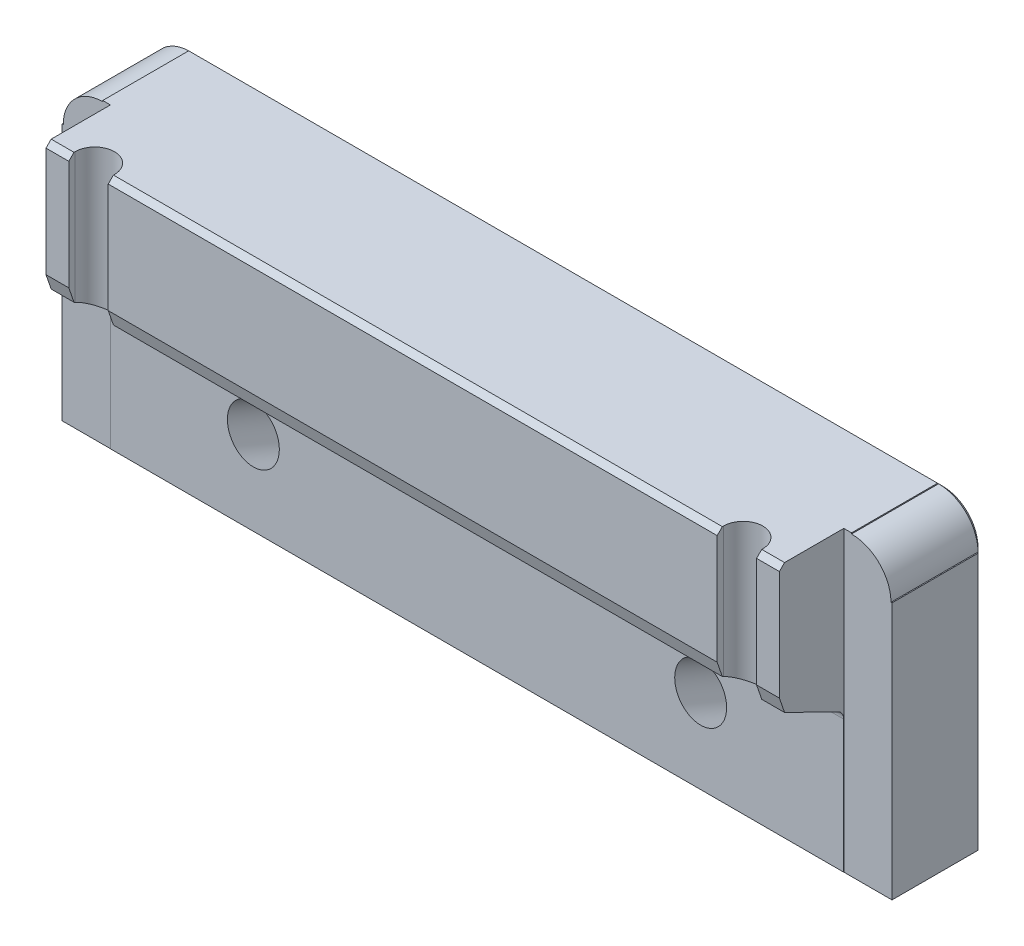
ISO-10303-21;
HEADER;
FILE_DESCRIPTION(('STEP AP214'),'2;1');
FILE_NAME('part.step','',(''),(''),'','','');
FILE_SCHEMA(('AUTOMOTIVE_DESIGN { 1 0 10303 214 1 1 1 1 }'));
ENDSEC;
DATA;
#1=APPLICATION_CONTEXT('core data for automotive mechanical design processes');
#2=APPLICATION_PROTOCOL_DEFINITION('international standard','automotive_design',2000,#1);
#3=PRODUCT_CONTEXT('',#1,'mechanical');
#4=PRODUCT('Part','Part','',(#3));
#5=PRODUCT_RELATED_PRODUCT_CATEGORY('part','',(#4));
#6=PRODUCT_DEFINITION_FORMATION('','',#4);
#7=PRODUCT_DEFINITION_CONTEXT('part definition',#1,'design');
#8=PRODUCT_DEFINITION('design','',#6,#7);
#9=PRODUCT_DEFINITION_SHAPE('','',#8);
#10=(LENGTH_UNIT() NAMED_UNIT(*) SI_UNIT(.MILLI.,.METRE.));
#11=(NAMED_UNIT(*) PLANE_ANGLE_UNIT() SI_UNIT($,.RADIAN.));
#12=(NAMED_UNIT(*) SI_UNIT($,.STERADIAN.) SOLID_ANGLE_UNIT());
#13=UNCERTAINTY_MEASURE_WITH_UNIT(LENGTH_MEASURE(1.E-05),#10,'distance_accuracy_value','');
#14=(GEOMETRIC_REPRESENTATION_CONTEXT(3) GLOBAL_UNCERTAINTY_ASSIGNED_CONTEXT((#13)) GLOBAL_UNIT_ASSIGNED_CONTEXT((#10,
#11,#12)) REPRESENTATION_CONTEXT('',''));
#15=CARTESIAN_POINT('',(0.,0.,0.));
#16=DIRECTION('',(0.,0.,1.));
#17=DIRECTION('',(1.,0.,0.));
#18=AXIS2_PLACEMENT_3D('',#15,#16,#17);
#19=CARTESIAN_POINT('',(101.5873,8.3375937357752,38.1));
#20=DIRECTION('',(0.,0.,-1.));
#21=DIRECTION('',(0.,1.,0.));
#22=AXIS2_PLACEMENT_3D('',#19,#20,#21);
#23=PLANE('',#22);
#24=DIRECTION('',(0.,-1.,0.));
#25=VECTOR('',#24,1.);
#26=CARTESIAN_POINT('',(-84.201,8.3375937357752,38.1));
#27=LINE('',#26,#25);
#28=CARTESIAN_POINT('',(-84.201,35.179,38.1));
#29=VERTEX_POINT('',#28);
#30=CARTESIAN_POINT('',(-84.201,8.3375937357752,38.1));
#31=VERTEX_POINT('',#30);
#32=EDGE_CURVE('E373',#29,#31,#27,.T.);
#33=ORIENTED_EDGE('',*,*,#32,.F.);
#34=DIRECTION('',(-1.,0.,0.));
#35=VECTOR('',#34,1.);
#36=CARTESIAN_POINT('',(101.5873,35.179,38.1));
#37=LINE('',#36,#35);
#38=CARTESIAN_POINT('',(-89.789,35.179,38.1));
#39=VERTEX_POINT('',#38);
#40=EDGE_CURVE('E559',#29,#39,#37,.T.);
#41=ORIENTED_EDGE('',*,*,#40,.T.);
#42=DIRECTION('',(0.,-1.,0.));
#43=VECTOR('',#42,1.);
#44=CARTESIAN_POINT('',(-89.789,38.3995230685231,38.1));
#45=LINE('',#44,#43);
#46=CARTESIAN_POINT('',(-89.789,8.33759373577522,38.1));
#47=VERTEX_POINT('',#46);
#48=EDGE_CURVE('E418',#39,#47,#45,.T.);
#49=ORIENTED_EDGE('',*,*,#48,.T.);
#50=DIRECTION('',(-1.,0.,0.));
#51=VECTOR('',#50,1.);
#52=CARTESIAN_POINT('',(101.5873,8.3375937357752,38.1));
#53=LINE('',#52,#51);
#54=EDGE_CURVE('E472',#31,#47,#53,.T.);
#55=ORIENTED_EDGE('',*,*,#54,.F.);
#56=EDGE_LOOP('',(#33,#41,#49,#55));
#57=FACE_BOUND('',#56,.T.);
#58=ADVANCED_FACE('F15',(#57),#23,.F.);
#59=DIRECTION('',(0.,1.,0.));
#60=VECTOR('',#59,1.);
#61=CARTESIAN_POINT('',(74.549,8.3375937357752,38.1));
#62=LINE('',#61,#60);
#63=CARTESIAN_POINT('',(74.549,8.3375937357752,38.1));
#64=VERTEX_POINT('',#63);
#65=CARTESIAN_POINT('',(74.549,35.179,38.1));
#66=VERTEX_POINT('',#65);
#67=EDGE_CURVE('E396',#64,#66,#62,.T.);
#68=ORIENTED_EDGE('',*,*,#67,.T.);
#69=DIRECTION('',(-1.,0.,0.));
#70=VECTOR('',#69,1.);
#71=CARTESIAN_POINT('',(101.5873,35.179,38.1));
#72=LINE('',#71,#70);
#73=CARTESIAN_POINT('',(-74.549,35.179,38.1));
#74=VERTEX_POINT('',#73);
#75=EDGE_CURVE('E552',#66,#74,#72,.T.);
#76=ORIENTED_EDGE('',*,*,#75,.T.);
#77=DIRECTION('',(0.,1.,0.));
#78=VECTOR('',#77,1.);
#79=CARTESIAN_POINT('',(-74.549,8.3375937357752,38.1));
#80=LINE('',#79,#78);
#81=CARTESIAN_POINT('',(-74.549,8.3375937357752,38.1));
#82=VERTEX_POINT('',#81);
#83=EDGE_CURVE('E368',#82,#74,#80,.T.);
#84=ORIENTED_EDGE('',*,*,#83,.F.);
#85=EDGE_CURVE('E478',#64,#82,#53,.T.);
#86=ORIENTED_EDGE('',*,*,#85,.F.);
#87=EDGE_LOOP('',(#68,#76,#84,#86));
#88=FACE_BOUND('',#87,.T.);
#89=ADVANCED_FACE('F725',(#88),#23,.F.);
#90=CARTESIAN_POINT('',(101.5873,4.64924592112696,36.83));
#91=DIRECTION('',(0.,0.32556815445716,-0.945518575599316));
#92=DIRECTION('',(0.,0.945518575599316,0.32556815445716));
#93=AXIS2_PLACEMENT_3D('',#90,#91,#92);
#94=PLANE('',#93);
#95=DIRECTION('',(0.,-0.945518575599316,-0.32556815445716));
#96=VECTOR('',#95,1.);
#97=CARTESIAN_POINT('',(-84.201,4.64924592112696,36.83));
#98=LINE('',#97,#96);
#99=CARTESIAN_POINT('',(-84.201,4.64924592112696,36.83));
#100=VERTEX_POINT('',#99);
#101=EDGE_CURVE('E371',#31,#100,#98,.T.);
#102=ORIENTED_EDGE('',*,*,#101,.F.);
#103=ORIENTED_EDGE('',*,*,#54,.T.);
#104=DIRECTION('',(0.,0.945518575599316,0.32556815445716));
#105=VECTOR('',#104,1.);
#106=CARTESIAN_POINT('',(-89.789,4.64924592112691,36.83));
#107=LINE('',#106,#105);
#108=CARTESIAN_POINT('',(-89.789,4.64924592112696,36.83));
#109=VERTEX_POINT('',#108);
#110=EDGE_CURVE('E454',#109,#47,#107,.T.);
#111=ORIENTED_EDGE('',*,*,#110,.F.);
#112=DIRECTION('',(-1.,0.,0.));
#113=VECTOR('',#112,1.);
#114=CARTESIAN_POINT('',(101.5873,4.64924592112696,36.83));
#115=LINE('',#114,#113);
#116=EDGE_CURVE('E468',#100,#109,#115,.T.);
#117=ORIENTED_EDGE('',*,*,#116,.F.);
#118=EDGE_LOOP('',(#102,#103,#111,#117));
#119=FACE_BOUND('',#118,.T.);
#120=ADVANCED_FACE('F731',(#119),#94,.F.);
#121=DIRECTION('',(0.,0.945518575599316,0.32556815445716));
#122=VECTOR('',#121,1.);
#123=CARTESIAN_POINT('',(-74.549,4.64924592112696,36.83));
#124=LINE('',#123,#122);
#125=CARTESIAN_POINT('',(-74.549,4.64924592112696,36.83));
#126=VERTEX_POINT('',#125);
#127=EDGE_CURVE('E365',#126,#82,#124,.T.);
#128=ORIENTED_EDGE('',*,*,#127,.F.);
#129=CARTESIAN_POINT('',(74.549,4.64924592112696,36.83));
#130=VERTEX_POINT('',#129);
#131=EDGE_CURVE('E473',#130,#126,#115,.T.);
#132=ORIENTED_EDGE('',*,*,#131,.F.);
#133=DIRECTION('',(0.,0.945518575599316,0.32556815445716));
#134=VECTOR('',#133,1.);
#135=CARTESIAN_POINT('',(74.549,4.64924592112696,36.83));
#136=LINE('',#135,#134);
#137=EDGE_CURVE('E393',#130,#64,#136,.T.);
#138=ORIENTED_EDGE('',*,*,#137,.T.);
#139=ORIENTED_EDGE('',*,*,#85,.T.);
#140=EDGE_LOOP('',(#128,#132,#138,#139));
#141=FACE_BOUND('',#140,.T.);
#142=ADVANCED_FACE('F741',(#141),#94,.F.);
#143=CARTESIAN_POINT('',(101.5873,36.449,38.1));
#144=DIRECTION('',(0.,-1.,0.));
#145=DIRECTION('',(0.,0.,-1.));
#146=AXIS2_PLACEMENT_3D('',#143,#144,#145);
#147=PLANE('',#146);
#148=DIRECTION('',(0.,0.,-1.));
#149=VECTOR('',#148,1.);
#150=CARTESIAN_POINT('',(84.201,36.449,36.576));
#151=LINE('',#150,#149);
#152=CARTESIAN_POINT('',(84.201,36.449,36.83));
#153=VERTEX_POINT('',#152);
#154=CARTESIAN_POINT('',(84.201,36.449,36.576));
#155=VERTEX_POINT('',#154);
#156=EDGE_CURVE('E375',#153,#155,#151,.T.);
#157=ORIENTED_EDGE('',*,*,#156,.F.);
#158=DIRECTION('',(1.,0.,0.));
#159=VECTOR('',#158,1.);
#160=CARTESIAN_POINT('',(101.5873,36.449,36.83));
#161=LINE('',#160,#159);
#162=CARTESIAN_POINT('',(89.789,36.449,36.83));
#163=VERTEX_POINT('',#162);
#164=EDGE_CURVE('E548',#153,#163,#161,.T.);
#165=ORIENTED_EDGE('',*,*,#164,.T.);
#166=DIRECTION('',(0.,0.,1.));
#167=VECTOR('',#166,1.);
#168=CARTESIAN_POINT('',(89.789,36.449,38.1));
#169=LINE('',#168,#167);
#170=CARTESIAN_POINT('',(89.789,36.449,22.3266));
#171=VERTEX_POINT('',#170);
#172=EDGE_CURVE('E446',#171,#163,#169,.T.);
#173=ORIENTED_EDGE('',*,*,#172,.F.);
#174=DIRECTION('',(-1.,0.,0.));
#175=VECTOR('',#174,1.);
#176=CARTESIAN_POINT('',(101.5873,36.449,22.3266));
#177=LINE('',#176,#175);
#178=CARTESIAN_POINT('',(91.6813,36.449,22.3266));
#179=VERTEX_POINT('',#178);
#180=EDGE_CURVE('E436',#179,#171,#177,.T.);
#181=ORIENTED_EDGE('',*,*,#180,.F.);
#182=DIRECTION('',(0.,0.,-1.));
#183=VECTOR('',#182,1.);
#184=CARTESIAN_POINT('',(91.6813,36.449,38.1));
#185=LINE('',#184,#183);
#186=CARTESIAN_POINT('',(91.6813,36.449,1.26999999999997));
#187=VERTEX_POINT('',#186);
#188=EDGE_CURVE('E412',#179,#187,#185,.T.);
#189=ORIENTED_EDGE('',*,*,#188,.T.);
#190=DIRECTION('',(-1.,0.,0.));
#191=VECTOR('',#190,1.);
#192=CARTESIAN_POINT('',(101.5873,36.449,1.26999999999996));
#193=LINE('',#192,#191);
#194=CARTESIAN_POINT('',(-91.6813,36.449,1.26999999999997));
#195=VERTEX_POINT('',#194);
#196=EDGE_CURVE('E541',#187,#195,#193,.T.);
#197=ORIENTED_EDGE('',*,*,#196,.T.);
#198=DIRECTION('',(0.,0.,-1.));
#199=VECTOR('',#198,1.);
#200=CARTESIAN_POINT('',(-91.6813,36.449,38.1));
#201=LINE('',#200,#199);
#202=CARTESIAN_POINT('',(-91.6813,36.449,22.3266));
#203=VERTEX_POINT('',#202);
#204=EDGE_CURVE('E406',#203,#195,#201,.T.);
#205=ORIENTED_EDGE('',*,*,#204,.F.);
#206=CARTESIAN_POINT('',(-89.789,36.449,22.3266));
#207=VERTEX_POINT('',#206);
#208=EDGE_CURVE('E431',#207,#203,#177,.T.);
#209=ORIENTED_EDGE('',*,*,#208,.F.);
#210=DIRECTION('',(0.,0.,-1.));
#211=VECTOR('',#210,1.);
#212=CARTESIAN_POINT('',(-89.789,36.449,38.1));
#213=LINE('',#212,#211);
#214=CARTESIAN_POINT('',(-89.789,36.449,36.83));
#215=VERTEX_POINT('',#214);
#216=EDGE_CURVE('E457',#215,#207,#213,.T.);
#217=ORIENTED_EDGE('',*,*,#216,.F.);
#218=DIRECTION('',(1.,0.,0.));
#219=VECTOR('',#218,1.);
#220=CARTESIAN_POINT('',(101.5873,36.449,36.83));
#221=LINE('',#220,#219);
#222=CARTESIAN_POINT('',(-84.201,36.449,36.83));
#223=VERTEX_POINT('',#222);
#224=EDGE_CURVE('E544',#215,#223,#221,.T.);
#225=ORIENTED_EDGE('',*,*,#224,.T.);
#226=DIRECTION('',(0.,0.,-1.));
#227=VECTOR('',#226,1.);
#228=CARTESIAN_POINT('',(-84.201,36.449,36.576));
#229=LINE('',#228,#227);
#230=CARTESIAN_POINT('',(-84.201,36.449,36.576));
#231=VERTEX_POINT('',#230);
#232=EDGE_CURVE('E359',#223,#231,#229,.T.);
#233=ORIENTED_EDGE('',*,*,#232,.T.);
#234=CARTESIAN_POINT('',(-79.375,36.449,36.576));
#235=DIRECTION('',(0.,-1.,0.));
#236=DIRECTION('',(0.,0.,-1.));
#237=AXIS2_PLACEMENT_3D('',#234,#235,#236);
#238=CIRCLE('',#237,4.826);
#239=CARTESIAN_POINT('',(-74.549,36.449,36.576));
#240=VERTEX_POINT('',#239);
#241=EDGE_CURVE('E355',#231,#240,#238,.T.);
#242=ORIENTED_EDGE('',*,*,#241,.T.);
#243=DIRECTION('',(0.,0.,1.));
#244=VECTOR('',#243,1.);
#245=CARTESIAN_POINT('',(-74.549,36.449,56.3881036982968));
#246=LINE('',#245,#244);
#247=CARTESIAN_POINT('',(-74.549,36.449,36.83));
#248=VERTEX_POINT('',#247);
#249=EDGE_CURVE('E352',#240,#248,#246,.T.);
#250=ORIENTED_EDGE('',*,*,#249,.T.);
#251=DIRECTION('',(1.,0.,0.));
#252=VECTOR('',#251,1.);
#253=CARTESIAN_POINT('',(101.5873,36.449,36.83));
#254=LINE('',#253,#252);
#255=CARTESIAN_POINT('',(74.549,36.449,36.83));
#256=VERTEX_POINT('',#255);
#257=EDGE_CURVE('E546',#248,#256,#254,.T.);
#258=ORIENTED_EDGE('',*,*,#257,.T.);
#259=DIRECTION('',(0.,0.,1.));
#260=VECTOR('',#259,1.);
#261=CARTESIAN_POINT('',(74.549,36.449,56.3881036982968));
#262=LINE('',#261,#260);
#263=CARTESIAN_POINT('',(74.549,36.449,36.576));
#264=VERTEX_POINT('',#263);
#265=EDGE_CURVE('E380',#264,#256,#262,.T.);
#266=ORIENTED_EDGE('',*,*,#265,.F.);
#267=CARTESIAN_POINT('',(79.375,36.449,36.576));
#268=DIRECTION('',(0.,1.,0.));
#269=DIRECTION('',(0.,0.,-1.));
#270=AXIS2_PLACEMENT_3D('',#267,#268,#269);
#271=CIRCLE('',#270,4.826);
#272=EDGE_CURVE('E377',#155,#264,#271,.T.);
#273=ORIENTED_EDGE('',*,*,#272,.F.);
#274=EDGE_LOOP('',(#157,#165,#173,#181,#189,#197,#205,#209,#217,#225,#233,#242,#250,#258,#266,#273));
#275=FACE_BOUND('',#274,.T.);
#276=ADVANCED_FACE('F659',(#275),#147,.F.);
#277=CARTESIAN_POINT('',(101.5873,-2.41214649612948,22.352));
#278=DIRECTION('',(0.,0.89879404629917,-0.438371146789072));
#279=DIRECTION('',(0.,0.438371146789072,0.89879404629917));
#280=AXIS2_PLACEMENT_3D('',#277,#278,#279);
#281=PLANE('',#280);
#282=DIRECTION('',(0.,0.438371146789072,0.89879404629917));
#283=VECTOR('',#282,1.);
#284=CARTESIAN_POINT('',(-89.789,-2.41214649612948,22.352));
#285=LINE('',#284,#283);
#286=CARTESIAN_POINT('',(-89.789,-1.71637777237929,23.7785372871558));
#287=VERTEX_POINT('',#286);
#288=EDGE_CURVE('E452',#287,#109,#285,.T.);
#289=ORIENTED_EDGE('',*,*,#288,.F.);
#290=DIRECTION('',(-1.,0.,0.));
#291=VECTOR('',#290,1.);
#292=CARTESIAN_POINT('',(89.789,-1.71637777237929,23.7785372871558));
#293=LINE('',#292,#291);
#294=CARTESIAN_POINT('',(89.789,-1.71637777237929,23.7785372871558));
#295=VERTEX_POINT('',#294);
#296=EDGE_CURVE('E522',#287,#295,#293,.F.);
#297=ORIENTED_EDGE('',*,*,#296,.T.);
#298=DIRECTION('',(0.,-0.438371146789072,-0.89879404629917));
#299=VECTOR('',#298,1.);
#300=CARTESIAN_POINT('',(89.789,-2.41214649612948,22.352));
#301=LINE('',#300,#299);
#302=CARTESIAN_POINT('',(89.789,4.64924592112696,36.83));
#303=VERTEX_POINT('',#302);
#304=EDGE_CURVE('E441',#303,#295,#301,.T.);
#305=ORIENTED_EDGE('',*,*,#304,.F.);
#306=CARTESIAN_POINT('',(84.201,4.64924592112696,36.83));
#307=VERTEX_POINT('',#306);
#308=EDGE_CURVE('E469',#303,#307,#115,.T.);
#309=ORIENTED_EDGE('',*,*,#308,.T.);
#310=DIRECTION('',(0.,-0.438371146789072,-0.89879404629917));
#311=VECTOR('',#310,1.);
#312=CARTESIAN_POINT('',(84.201,-2.41214649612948,22.352));
#313=LINE('',#312,#311);
#314=CARTESIAN_POINT('',(84.201,4.52536184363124,36.576));
#315=VERTEX_POINT('',#314);
#316=EDGE_CURVE('E503',#307,#315,#313,.T.);
#317=ORIENTED_EDGE('',*,*,#316,.T.);
#318=CARTESIAN_POINT('',(79.375,4.52536184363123,36.576));
#319=DIRECTION('',(0.,0.89879404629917,-0.438371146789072));
#320=DIRECTION('',(0.,0.438371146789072,0.89879404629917));
#321=AXIS2_PLACEMENT_3D('',#318,#319,#320);
#322=ELLIPSE('',#321,5.36941696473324,4.826);
#323=CARTESIAN_POINT('',(74.549,4.52536184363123,36.576));
#324=VERTEX_POINT('',#323);
#325=EDGE_CURVE('E506',#315,#324,#322,.T.);
#326=ORIENTED_EDGE('',*,*,#325,.T.);
#327=DIRECTION('',(0.,0.438371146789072,0.89879404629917));
#328=VECTOR('',#327,1.);
#329=CARTESIAN_POINT('',(74.549,-2.41214649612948,22.352));
#330=LINE('',#329,#328);
#331=EDGE_CURVE('E509',#324,#130,#330,.T.);
#332=ORIENTED_EDGE('',*,*,#331,.T.);
#333=ORIENTED_EDGE('',*,*,#131,.T.);
#334=DIRECTION('',(0.,0.438371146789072,0.89879404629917));
#335=VECTOR('',#334,1.);
#336=CARTESIAN_POINT('',(-74.549,-2.41214649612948,22.352));
#337=LINE('',#336,#335);
#338=CARTESIAN_POINT('',(-74.549,4.52536184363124,36.576));
#339=VERTEX_POINT('',#338);
#340=EDGE_CURVE('E512',#339,#126,#337,.T.);
#341=ORIENTED_EDGE('',*,*,#340,.F.);
#342=CARTESIAN_POINT('',(-79.375,4.52536184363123,36.576));
#343=DIRECTION('',(0.,0.89879404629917,-0.438371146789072));
#344=DIRECTION('',(0.,0.438371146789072,0.89879404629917));
#345=AXIS2_PLACEMENT_3D('',#342,#343,#344);
#346=ELLIPSE('',#345,5.36941696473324,4.826);
#347=CARTESIAN_POINT('',(-84.201,4.52536184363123,36.576));
#348=VERTEX_POINT('',#347);
#349=EDGE_CURVE('E514',#348,#339,#346,.F.);
#350=ORIENTED_EDGE('',*,*,#349,.F.);
#351=DIRECTION('',(0.,-0.438371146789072,-0.89879404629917));
#352=VECTOR('',#351,1.);
#353=CARTESIAN_POINT('',(-84.201,-2.41214649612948,22.352));
#354=LINE('',#353,#352);
#355=EDGE_CURVE('E517',#100,#348,#354,.T.);
#356=ORIENTED_EDGE('',*,*,#355,.F.);
#357=ORIENTED_EDGE('',*,*,#116,.T.);
#358=EDGE_LOOP('',(#289,#297,#305,#309,#317,#326,#332,#333,#341,#350,#356,#357));
#359=FACE_BOUND('',#358,.T.);
#360=ADVANCED_FACE('F677',(#359),#281,.F.);
#361=CARTESIAN_POINT('',(-101.5873,36.449,0.));
#362=DIRECTION('',(-1.,0.,0.));
#363=DIRECTION('',(0.,0.,1.));
#364=AXIS2_PLACEMENT_3D('',#361,#362,#363);
#365=PLANE('',#364);
#366=DIRECTION('',(0.,0.,-1.));
#367=VECTOR('',#366,1.);
#368=CARTESIAN_POINT('',(-101.5873,26.543,0.));
#369=LINE('',#368,#367);
#370=CARTESIAN_POINT('',(-101.5873,26.543,22.3266));
#371=VERTEX_POINT('',#370);
#372=CARTESIAN_POINT('',(-101.5873,26.543,1.26999999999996));
#373=VERTEX_POINT('',#372);
#374=EDGE_CURVE('E402',#371,#373,#369,.T.);
#375=ORIENTED_EDGE('',*,*,#374,.T.);
#376=DIRECTION('',(0.,-1.,0.));
#377=VECTOR('',#376,1.);
#378=CARTESIAN_POINT('',(-101.5873,-36.449,1.26999999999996));
#379=LINE('',#378,#377);
#380=CARTESIAN_POINT('',(-101.5873,-36.449,1.26999999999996));
#381=VERTEX_POINT('',#380);
#382=EDGE_CURVE('E582',#373,#381,#379,.T.);
#383=ORIENTED_EDGE('',*,*,#382,.T.);
#384=DIRECTION('',(0.,0.,-1.));
#385=VECTOR('',#384,1.);
#386=CARTESIAN_POINT('',(-101.5873,-36.449,0.));
#387=LINE('',#386,#385);
#388=CARTESIAN_POINT('',(-101.5873,-36.449,22.3266));
#389=VERTEX_POINT('',#388);
#390=EDGE_CURVE('E459',#389,#381,#387,.T.);
#391=ORIENTED_EDGE('',*,*,#390,.F.);
#392=DIRECTION('',(0.,1.,0.));
#393=VECTOR('',#392,1.);
#394=CARTESIAN_POINT('',(-101.5873,36.449,22.3266));
#395=LINE('',#394,#393);
#396=EDGE_CURVE('E477',#389,#371,#395,.T.);
#397=ORIENTED_EDGE('',*,*,#396,.T.);
#398=EDGE_LOOP('',(#375,#383,#391,#397));
#399=FACE_BOUND('',#398,.T.);
#400=ADVANCED_FACE('F620',(#399),#365,.T.);
#401=CARTESIAN_POINT('',(101.5873,36.449,0.));
#402=DIRECTION('',(0.,0.,1.));
#403=DIRECTION('',(1.,0.,0.));
#404=AXIS2_PLACEMENT_3D('',#401,#402,#403);
#405=PLANE('',#404);
#406=CARTESIAN_POINT('',(83.82,-26.162,0.));
#407=DIRECTION('',(0.,0.,-1.));
#408=DIRECTION('',(-1.,0.,0.));
#409=AXIS2_PLACEMENT_3D('',#406,#407,#408);
#410=CIRCLE('',#409,3.96875);
#411=CARTESIAN_POINT('',(79.85125,-26.162,0.));
#412=VERTEX_POINT('',#411);
#413=EDGE_CURVE('E274',#412,#412,#410,.T.);
#414=ORIENTED_EDGE('',*,*,#413,.F.);
#415=EDGE_LOOP('',(#414));
#416=FACE_BOUND('',#415,.T.);
#417=CARTESIAN_POINT('',(83.82,26.162,0.));
#418=DIRECTION('',(0.,0.,-1.));
#419=DIRECTION('',(-1.,0.,0.));
#420=AXIS2_PLACEMENT_3D('',#417,#418,#419);
#421=CIRCLE('',#420,3.96875);
#422=CARTESIAN_POINT('',(79.85125,26.162,0.));
#423=VERTEX_POINT('',#422);
#424=EDGE_CURVE('E286',#423,#423,#421,.T.);
#425=ORIENTED_EDGE('',*,*,#424,.F.);
#426=EDGE_LOOP('',(#425));
#427=FACE_BOUND('',#426,.T.);
#428=CARTESIAN_POINT('',(0.,26.162,0.));
#429=DIRECTION('',(0.,0.,-1.));
#430=DIRECTION('',(-1.,0.,0.));
#431=AXIS2_PLACEMENT_3D('',#428,#429,#430);
#432=CIRCLE('',#431,3.96875);
#433=CARTESIAN_POINT('',(-3.96875,26.162,0.));
#434=VERTEX_POINT('',#433);
#435=EDGE_CURVE('E298',#434,#434,#432,.T.);
#436=ORIENTED_EDGE('',*,*,#435,.F.);
#437=EDGE_LOOP('',(#436));
#438=FACE_BOUND('',#437,.T.);
#439=CARTESIAN_POINT('',(0.,-26.162,0.));
#440=DIRECTION('',(0.,0.,-1.));
#441=DIRECTION('',(-1.,0.,0.));
#442=AXIS2_PLACEMENT_3D('',#439,#440,#441);
#443=CIRCLE('',#442,3.96875);
#444=CARTESIAN_POINT('',(-3.96875,-26.162,0.));
#445=VERTEX_POINT('',#444);
#446=EDGE_CURVE('E310',#445,#445,#443,.T.);
#447=ORIENTED_EDGE('',*,*,#446,.F.);
#448=EDGE_LOOP('',(#447));
#449=FACE_BOUND('',#448,.T.);
#450=CARTESIAN_POINT('',(-83.82,-26.162,0.));
#451=DIRECTION('',(0.,0.,-1.));
#452=DIRECTION('',(-1.,0.,0.));
#453=AXIS2_PLACEMENT_3D('',#450,#451,#452);
#454=CIRCLE('',#453,3.96875);
#455=CARTESIAN_POINT('',(-87.78875,-26.162,0.));
#456=VERTEX_POINT('',#455);
#457=EDGE_CURVE('E322',#456,#456,#454,.T.);
#458=ORIENTED_EDGE('',*,*,#457,.F.);
#459=EDGE_LOOP('',(#458));
#460=FACE_BOUND('',#459,.T.);
#461=CARTESIAN_POINT('',(-83.82,26.162,0.));
#462=DIRECTION('',(0.,0.,-1.));
#463=DIRECTION('',(-1.,0.,0.));
#464=AXIS2_PLACEMENT_3D('',#461,#462,#463);
#465=CIRCLE('',#464,3.96875);
#466=CARTESIAN_POINT('',(-87.78875,26.162,0.));
#467=VERTEX_POINT('',#466);
#468=EDGE_CURVE('E334',#467,#467,#465,.T.);
#469=ORIENTED_EDGE('',*,*,#468,.F.);
#470=EDGE_LOOP('',(#469));
#471=FACE_BOUND('',#470,.T.);
#472=CARTESIAN_POINT('',(-54.7624,-25.3746,0.));
#473=DIRECTION('',(0.,0.,1.));
#474=DIRECTION('',(0.,-1.,0.));
#475=AXIS2_PLACEMENT_3D('',#472,#473,#474);
#476=ELLIPSE('',#475,9.51977598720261,8.763);
#477=CARTESIAN_POINT('',(-54.7624,-34.8943759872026,0.));
#478=VERTEX_POINT('',#477);
#479=EDGE_CURVE('E348',#478,#478,#476,.T.);
#480=ORIENTED_EDGE('',*,*,#479,.T.);
#481=EDGE_LOOP('',(#480));
#482=FACE_BOUND('',#481,.T.);
#483=CARTESIAN_POINT('',(54.7624,-25.3746,0.));
#484=DIRECTION('',(0.,0.,1.));
#485=DIRECTION('',(0.,-1.,0.));
#486=AXIS2_PLACEMENT_3D('',#483,#484,#485);
#487=ELLIPSE('',#486,9.51977598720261,8.763);
#488=CARTESIAN_POINT('',(54.7624,-34.8943759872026,0.));
#489=VERTEX_POINT('',#488);
#490=EDGE_CURVE('E356',#489,#489,#487,.T.);
#491=ORIENTED_EDGE('',*,*,#490,.T.);
#492=EDGE_LOOP('',(#491));
#493=FACE_BOUND('',#492,.T.);
#494=DIRECTION('',(1.,0.,0.));
#495=VECTOR('',#494,1.);
#496=CARTESIAN_POINT('',(101.5873,35.179,0.));
#497=LINE('',#496,#495);
#498=CARTESIAN_POINT('',(-91.6813,35.179,0.));
#499=VERTEX_POINT('',#498);
#500=CARTESIAN_POINT('',(91.6813,35.179,0.));
#501=VERTEX_POINT('',#500);
#502=EDGE_CURVE('E575',#499,#501,#497,.T.);
#503=ORIENTED_EDGE('',*,*,#502,.T.);
#504=CARTESIAN_POINT('',(91.6813,26.543,0.));
#505=DIRECTION('',(0.,0.,1.));
#506=DIRECTION('',(1.,0.,0.));
#507=AXIS2_PLACEMENT_3D('',#504,#505,#506);
#508=CIRCLE('',#507,8.636);
#509=CARTESIAN_POINT('',(100.3173,26.543,0.));
#510=VERTEX_POINT('',#509);
#511=EDGE_CURVE('E595',#501,#510,#508,.F.);
#512=ORIENTED_EDGE('',*,*,#511,.T.);
#513=DIRECTION('',(0.,-1.,0.));
#514=VECTOR('',#513,1.);
#515=CARTESIAN_POINT('',(100.3173,36.449,0.));
#516=LINE('',#515,#514);
#517=CARTESIAN_POINT('',(100.3173,-35.179,0.));
#518=VERTEX_POINT('',#517);
#519=EDGE_CURVE('E569',#510,#518,#516,.T.);
#520=ORIENTED_EDGE('',*,*,#519,.T.);
#521=DIRECTION('',(-1.,0.,0.));
#522=VECTOR('',#521,1.);
#523=CARTESIAN_POINT('',(101.5873,-35.179,0.));
#524=LINE('',#523,#522);
#525=CARTESIAN_POINT('',(-100.3173,-35.179,0.));
#526=VERTEX_POINT('',#525);
#527=EDGE_CURVE('E571',#518,#526,#524,.T.);
#528=ORIENTED_EDGE('',*,*,#527,.T.);
#529=DIRECTION('',(0.,1.,0.));
#530=VECTOR('',#529,1.);
#531=CARTESIAN_POINT('',(-100.3173,26.543,0.));
#532=LINE('',#531,#530);
#533=CARTESIAN_POINT('',(-100.3173,26.543,0.));
#534=VERTEX_POINT('',#533);
#535=EDGE_CURVE('E573',#526,#534,#532,.T.);
#536=ORIENTED_EDGE('',*,*,#535,.T.);
#537=CARTESIAN_POINT('',(-91.6813,26.543,0.));
#538=DIRECTION('',(0.,0.,1.));
#539=DIRECTION('',(1.,0.,0.));
#540=AXIS2_PLACEMENT_3D('',#537,#538,#539);
#541=CIRCLE('',#540,8.636);
#542=EDGE_CURVE('E591',#534,#499,#541,.F.);
#543=ORIENTED_EDGE('',*,*,#542,.T.);
#544=EDGE_LOOP('',(#503,#512,#520,#528,#536,#543));
#545=FACE_BOUND('',#544,.T.);
#546=ADVANCED_FACE('F706',(#416,#427,#438,#449,#460,#471,#482,#493,#545),#405,.F.);
#547=CARTESIAN_POINT('',(0.,-9.82235179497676,22.3266));
#548=DIRECTION('',(0.,0.,1.));
#549=DIRECTION('',(1.,0.,0.));
#550=AXIS2_PLACEMENT_3D('',#547,#548,#549);
#551=PLANE('',#550);
#552=ORIENTED_EDGE('',*,*,#208,.T.);
#553=DIRECTION('',(0.,-1.,0.));
#554=VECTOR('',#553,1.);
#555=CARTESIAN_POINT('',(-91.6813,-9.82235179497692,22.3266));
#556=LINE('',#555,#554);
#557=CARTESIAN_POINT('',(-91.6813,36.195,22.3266));
#558=VERTEX_POINT('',#557);
#559=EDGE_CURVE('E500',#203,#558,#556,.T.);
#560=ORIENTED_EDGE('',*,*,#559,.T.);
#561=CARTESIAN_POINT('',(-91.6813,26.543,22.3266));
#562=DIRECTION('',(0.,0.,1.));
#563=DIRECTION('',(1.,0.,0.));
#564=AXIS2_PLACEMENT_3D('',#561,#562,#563);
#565=CIRCLE('',#564,9.652);
#566=CARTESIAN_POINT('',(-101.3333,26.543,22.3266));
#567=VERTEX_POINT('',#566);
#568=EDGE_CURVE('E497',#558,#567,#565,.T.);
#569=ORIENTED_EDGE('',*,*,#568,.T.);
#570=DIRECTION('',(-1.,0.,0.));
#571=VECTOR('',#570,1.);
#572=CARTESIAN_POINT('',(0.,26.543,22.3266));
#573=LINE('',#572,#571);
#574=EDGE_CURVE('E494',#567,#371,#573,.T.);
#575=ORIENTED_EDGE('',*,*,#574,.T.);
#576=ORIENTED_EDGE('',*,*,#396,.F.);
#577=DIRECTION('',(1.,0.,0.));
#578=VECTOR('',#577,1.);
#579=CARTESIAN_POINT('',(101.5873,-36.449,22.3266));
#580=LINE('',#579,#578);
#581=CARTESIAN_POINT('',(-89.789,-36.449,22.3266));
#582=VERTEX_POINT('',#581);
#583=EDGE_CURVE('E429',#389,#582,#580,.T.);
#584=ORIENTED_EDGE('',*,*,#583,.T.);
#585=DIRECTION('',(0.,-1.,0.));
#586=VECTOR('',#585,1.);
#587=CARTESIAN_POINT('',(-89.789,38.3995230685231,22.3266));
#588=LINE('',#587,#586);
#589=EDGE_CURVE('E423',#207,#582,#588,.T.);
#590=ORIENTED_EDGE('',*,*,#589,.F.);
#591=EDGE_LOOP('',(#552,#560,#569,#575,#576,#584,#590));
#592=FACE_BOUND('',#591,.T.);
#593=ADVANCED_FACE('F694',(#592),#551,.T.);
#594=DIRECTION('',(0.,1.,0.));
#595=VECTOR('',#594,1.);
#596=CARTESIAN_POINT('',(89.789,38.3995230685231,38.1));
#597=LINE('',#596,#595);
#598=CARTESIAN_POINT('',(89.789,8.33759373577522,38.1));
#599=VERTEX_POINT('',#598);
#600=CARTESIAN_POINT('',(89.789,35.179,38.1));
#601=VERTEX_POINT('',#600);
#602=EDGE_CURVE('E420',#599,#601,#597,.T.);
#603=ORIENTED_EDGE('',*,*,#602,.T.);
#604=DIRECTION('',(-1.,0.,0.));
#605=VECTOR('',#604,1.);
#606=CARTESIAN_POINT('',(101.5873,35.179,38.1));
#607=LINE('',#606,#605);
#608=CARTESIAN_POINT('',(84.201,35.179,38.1));
#609=VERTEX_POINT('',#608);
#610=EDGE_CURVE('E528',#601,#609,#607,.T.);
#611=ORIENTED_EDGE('',*,*,#610,.T.);
#612=DIRECTION('',(0.,-1.,0.));
#613=VECTOR('',#612,1.);
#614=CARTESIAN_POINT('',(84.201,8.3375937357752,38.1));
#615=LINE('',#614,#613);
#616=CARTESIAN_POINT('',(84.201,8.3375937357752,38.1));
#617=VERTEX_POINT('',#616);
#618=EDGE_CURVE('E391',#609,#617,#615,.T.);
#619=ORIENTED_EDGE('',*,*,#618,.T.);
#620=EDGE_CURVE('E474',#599,#617,#53,.T.);
#621=ORIENTED_EDGE('',*,*,#620,.F.);
#622=EDGE_LOOP('',(#603,#611,#619,#621));
#623=FACE_BOUND('',#622,.T.);
#624=ADVANCED_FACE('F667',(#623),#23,.F.);
#625=ORIENTED_EDGE('',*,*,#620,.T.);
#626=DIRECTION('',(0.,-0.945518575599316,-0.32556815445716));
#627=VECTOR('',#626,1.);
#628=CARTESIAN_POINT('',(84.201,4.64924592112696,36.83));
#629=LINE('',#628,#627);
#630=EDGE_CURVE('E386',#617,#307,#629,.T.);
#631=ORIENTED_EDGE('',*,*,#630,.T.);
#632=ORIENTED_EDGE('',*,*,#308,.F.);
#633=DIRECTION('',(0.,-0.945518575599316,-0.32556815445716));
#634=VECTOR('',#633,1.);
#635=CARTESIAN_POINT('',(89.789,4.64924592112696,36.83));
#636=LINE('',#635,#634);
#637=EDGE_CURVE('E444',#599,#303,#636,.T.);
#638=ORIENTED_EDGE('',*,*,#637,.F.);
#639=EDGE_LOOP('',(#625,#631,#632,#638));
#640=FACE_BOUND('',#639,.T.);
#641=ADVANCED_FACE('F671',(#640),#94,.F.);
#642=CARTESIAN_POINT('',(101.5873,-36.449,22.352));
#643=DIRECTION('',(0.,0.,-1.));
#644=DIRECTION('',(0.,1.,0.));
#645=AXIS2_PLACEMENT_3D('',#642,#643,#644);
#646=PLANE('',#645);
#647=CARTESIAN_POINT('',(-54.7624,-15.8867389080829,22.352));
#648=DIRECTION('',(0.,0.,-1.));
#649=DIRECTION('',(0.,-1.,0.));
#650=AXIS2_PLACEMENT_3D('',#647,#648,#649);
#651=ELLIPSE('',#650,6.90528678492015,6.35635);
#652=CARTESIAN_POINT('',(-54.7624,-22.792025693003,22.352));
#653=VERTEX_POINT('',#652);
#654=EDGE_CURVE('E343',#653,#653,#651,.T.);
#655=ORIENTED_EDGE('',*,*,#654,.T.);
#656=EDGE_LOOP('',(#655));
#657=FACE_BOUND('',#656,.T.);
#658=CARTESIAN_POINT('',(54.7624,-15.8867389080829,22.352));
#659=DIRECTION('',(0.,0.,-1.));
#660=DIRECTION('',(0.,-1.,0.));
#661=AXIS2_PLACEMENT_3D('',#658,#659,#660);
#662=ELLIPSE('',#661,6.90528678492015,6.35635);
#663=CARTESIAN_POINT('',(54.7624,-22.792025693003,22.352));
#664=VERTEX_POINT('',#663);
#665=EDGE_CURVE('E351',#664,#664,#662,.T.);
#666=ORIENTED_EDGE('',*,*,#665,.T.);
#667=EDGE_LOOP('',(#666));
#668=FACE_BOUND('',#667,.T.);
#669=DIRECTION('',(0.,-1.,0.));
#670=VECTOR('',#669,1.);
#671=CARTESIAN_POINT('',(89.789,-36.449,22.352));
#672=LINE('',#671,#670);
#673=CARTESIAN_POINT('',(89.789,-3.99931464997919,22.352));
#674=VERTEX_POINT('',#673);
#675=CARTESIAN_POINT('',(89.789,-36.449,22.352));
#676=VERTEX_POINT('',#675);
#677=EDGE_CURVE('E439',#674,#676,#672,.T.);
#678=ORIENTED_EDGE('',*,*,#677,.F.);
#679=DIRECTION('',(-1.,0.,0.));
#680=VECTOR('',#679,1.);
#681=CARTESIAN_POINT('',(-89.789,-3.99931464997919,22.352));
#682=LINE('',#681,#680);
#683=CARTESIAN_POINT('',(-89.789,-3.99931464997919,22.352));
#684=VERTEX_POINT('',#683);
#685=EDGE_CURVE('E519',#674,#684,#682,.T.);
#686=ORIENTED_EDGE('',*,*,#685,.T.);
#687=DIRECTION('',(0.,1.,0.));
#688=VECTOR('',#687,1.);
#689=CARTESIAN_POINT('',(-89.789,-36.449,22.352));
#690=LINE('',#689,#688);
#691=CARTESIAN_POINT('',(-89.789,-36.449,22.352));
#692=VERTEX_POINT('',#691);
#693=EDGE_CURVE('E449',#692,#684,#690,.T.);
#694=ORIENTED_EDGE('',*,*,#693,.F.);
#695=DIRECTION('',(-1.,0.,0.));
#696=VECTOR('',#695,1.);
#697=CARTESIAN_POINT('',(101.5873,-36.449,22.352));
#698=LINE('',#697,#696);
#699=EDGE_CURVE('E463',#676,#692,#698,.T.);
#700=ORIENTED_EDGE('',*,*,#699,.F.);
#701=EDGE_LOOP('',(#678,#686,#694,#700));
#702=FACE_BOUND('',#701,.T.);
#703=ADVANCED_FACE('F685',(#657,#668,#702),#646,.F.);
#704=CARTESIAN_POINT('',(101.5873,-36.449,0.));
#705=DIRECTION('',(0.,1.,0.));
#706=DIRECTION('',(0.,0.,1.));
#707=AXIS2_PLACEMENT_3D('',#704,#705,#706);
#708=PLANE('',#707);
#709=ORIENTED_EDGE('',*,*,#390,.T.);
#710=DIRECTION('',(1.,0.,0.));
#711=VECTOR('',#710,1.);
#712=CARTESIAN_POINT('',(101.5873,-36.449,1.26999999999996));
#713=LINE('',#712,#711);
#714=CARTESIAN_POINT('',(101.5873,-36.449,1.26999999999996));
#715=VERTEX_POINT('',#714);
#716=EDGE_CURVE('E584',#381,#715,#713,.T.);
#717=ORIENTED_EDGE('',*,*,#716,.T.);
#718=DIRECTION('',(0.,0.,-1.));
#719=VECTOR('',#718,1.);
#720=CARTESIAN_POINT('',(101.5873,-36.449,0.));
#721=LINE('',#720,#719);
#722=CARTESIAN_POINT('',(101.5873,-36.449,22.3266));
#723=VERTEX_POINT('',#722);
#724=EDGE_CURVE('E460',#723,#715,#721,.T.);
#725=ORIENTED_EDGE('',*,*,#724,.F.);
#726=CARTESIAN_POINT('',(89.789,-36.449,22.3266));
#727=VERTEX_POINT('',#726);
#728=EDGE_CURVE('E432',#727,#723,#580,.T.);
#729=ORIENTED_EDGE('',*,*,#728,.F.);
#730=DIRECTION('',(0.,0.,-1.));
#731=VECTOR('',#730,1.);
#732=CARTESIAN_POINT('',(89.789,-36.449,0.));
#733=LINE('',#732,#731);
#734=EDGE_CURVE('E481',#676,#727,#733,.T.);
#735=ORIENTED_EDGE('',*,*,#734,.F.);
#736=ORIENTED_EDGE('',*,*,#699,.T.);
#737=DIRECTION('',(0.,0.,1.));
#738=VECTOR('',#737,1.);
#739=CARTESIAN_POINT('',(-89.789,-36.449,0.));
#740=LINE('',#739,#738);
#741=EDGE_CURVE('E483',#582,#692,#740,.T.);
#742=ORIENTED_EDGE('',*,*,#741,.F.);
#743=ORIENTED_EDGE('',*,*,#583,.F.);
#744=EDGE_LOOP('',(#709,#717,#725,#729,#735,#736,#742,#743));
#745=FACE_BOUND('',#744,.T.);
#746=ADVANCED_FACE('F624',(#745),#708,.F.);
#747=CARTESIAN_POINT('',(101.5873,36.449,0.));
#748=DIRECTION('',(-1.,0.,0.));
#749=DIRECTION('',(0.,0.,1.));
#750=AXIS2_PLACEMENT_3D('',#747,#748,#749);
#751=PLANE('',#750);
#752=ORIENTED_EDGE('',*,*,#724,.T.);
#753=DIRECTION('',(0.,1.,0.));
#754=VECTOR('',#753,1.);
#755=CARTESIAN_POINT('',(101.5873,36.449,1.26999999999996));
#756=LINE('',#755,#754);
#757=CARTESIAN_POINT('',(101.5873,26.543,1.26999999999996));
#758=VERTEX_POINT('',#757);
#759=EDGE_CURVE('E586',#715,#758,#756,.T.);
#760=ORIENTED_EDGE('',*,*,#759,.T.);
#761=DIRECTION('',(0.,0.,1.));
#762=VECTOR('',#761,1.);
#763=CARTESIAN_POINT('',(101.5873,26.543,0.));
#764=LINE('',#763,#762);
#765=CARTESIAN_POINT('',(101.5873,26.543,22.3266));
#766=VERTEX_POINT('',#765);
#767=EDGE_CURVE('E416',#758,#766,#764,.T.);
#768=ORIENTED_EDGE('',*,*,#767,.T.);
#769=DIRECTION('',(0.,1.,0.));
#770=VECTOR('',#769,1.);
#771=CARTESIAN_POINT('',(101.5873,36.449,22.3266));
#772=LINE('',#771,#770);
#773=EDGE_CURVE('E435',#723,#766,#772,.T.);
#774=ORIENTED_EDGE('',*,*,#773,.F.);
#775=EDGE_LOOP('',(#752,#760,#768,#774));
#776=FACE_BOUND('',#775,.T.);
#777=ADVANCED_FACE('F638',(#776),#751,.F.);
#778=CARTESIAN_POINT('',(-89.789,38.3995230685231,22.3266));
#779=DIRECTION('',(-1.,0.,0.));
#780=DIRECTION('',(0.,-1.,0.));
#781=AXIS2_PLACEMENT_3D('',#778,#779,#780);
#782=PLANE('',#781);
#783=ORIENTED_EDGE('',*,*,#48,.F.);
#784=DIRECTION('',(0.,-0.707106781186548,0.707106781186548));
#785=VECTOR('',#784,1.);
#786=CARTESIAN_POINT('',(-89.789,44.6759615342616,28.6030384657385));
#787=LINE('',#786,#785);
#788=EDGE_CURVE('E562',#39,#215,#787,.F.);
#789=ORIENTED_EDGE('',*,*,#788,.T.);
#790=ORIENTED_EDGE('',*,*,#216,.T.);
#791=ORIENTED_EDGE('',*,*,#589,.T.);
#792=ORIENTED_EDGE('',*,*,#741,.T.);
#793=ORIENTED_EDGE('',*,*,#693,.T.);
#794=CARTESIAN_POINT('',(-89.789,-3.99931464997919,24.892));
#795=DIRECTION('',(-1.,0.,0.));
#796=DIRECTION('',(0.,-1.,0.));
#797=AXIS2_PLACEMENT_3D('',#794,#795,#796);
#798=CIRCLE('',#797,2.54);
#799=EDGE_CURVE('E524',#684,#287,#798,.F.);
#800=ORIENTED_EDGE('',*,*,#799,.T.);
#801=ORIENTED_EDGE('',*,*,#288,.T.);
#802=ORIENTED_EDGE('',*,*,#110,.T.);
#803=EDGE_LOOP('',(#783,#789,#790,#791,#792,#793,#800,#801,#802));
#804=FACE_BOUND('',#803,.T.);
#805=ADVANCED_FACE('F689',(#804),#782,.T.);
#806=CARTESIAN_POINT('',(89.789,38.3995230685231,22.3266));
#807=DIRECTION('',(1.,0.,0.));
#808=DIRECTION('',(0.,0.,-1.));
#809=AXIS2_PLACEMENT_3D('',#806,#807,#808);
#810=PLANE('',#809);
#811=ORIENTED_EDGE('',*,*,#172,.T.);
#812=DIRECTION('',(0.,0.707106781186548,-0.707106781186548));
#813=VECTOR('',#812,1.);
#814=CARTESIAN_POINT('',(89.789,44.6759615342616,28.6030384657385));
#815=LINE('',#814,#813);
#816=EDGE_CURVE('E550',#163,#601,#815,.F.);
#817=ORIENTED_EDGE('',*,*,#816,.T.);
#818=ORIENTED_EDGE('',*,*,#602,.F.);
#819=ORIENTED_EDGE('',*,*,#637,.T.);
#820=ORIENTED_EDGE('',*,*,#304,.T.);
#821=CARTESIAN_POINT('',(89.789,-3.99931464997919,24.892));
#822=DIRECTION('',(1.,0.,0.));
#823=DIRECTION('',(0.,0.,-1.));
#824=AXIS2_PLACEMENT_3D('',#821,#822,#823);
#825=CIRCLE('',#824,2.54);
#826=EDGE_CURVE('E526',#295,#674,#825,.F.);
#827=ORIENTED_EDGE('',*,*,#826,.T.);
#828=ORIENTED_EDGE('',*,*,#677,.T.);
#829=ORIENTED_EDGE('',*,*,#734,.T.);
#830=DIRECTION('',(0.,1.,0.));
#831=VECTOR('',#830,1.);
#832=CARTESIAN_POINT('',(89.789,38.3995230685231,22.3266));
#833=LINE('',#832,#831);
#834=EDGE_CURVE('E426',#727,#171,#833,.T.);
#835=ORIENTED_EDGE('',*,*,#834,.T.);
#836=EDGE_LOOP('',(#811,#817,#818,#819,#820,#827,#828,#829,#835));
#837=FACE_BOUND('',#836,.T.);
#838=ADVANCED_FACE('F656',(#837),#810,.T.);
#839=DIRECTION('',(1.,0.,0.));
#840=VECTOR('',#839,1.);
#841=CARTESIAN_POINT('',(0.,26.543,22.3266));
#842=LINE('',#841,#840);
#843=CARTESIAN_POINT('',(101.3333,26.543,22.3266));
#844=VERTEX_POINT('',#843);
#845=EDGE_CURVE('E491',#844,#766,#842,.T.);
#846=ORIENTED_EDGE('',*,*,#845,.F.);
#847=CARTESIAN_POINT('',(91.6813,26.543,22.3266));
#848=DIRECTION('',(0.,0.,1.));
#849=DIRECTION('',(1.,0.,0.));
#850=AXIS2_PLACEMENT_3D('',#847,#848,#849);
#851=CIRCLE('',#850,9.652);
#852=CARTESIAN_POINT('',(91.6813,36.195,22.3266));
#853=VERTEX_POINT('',#852);
#854=EDGE_CURVE('E488',#853,#844,#851,.F.);
#855=ORIENTED_EDGE('',*,*,#854,.F.);
#856=DIRECTION('',(0.,-1.,0.));
#857=VECTOR('',#856,1.);
#858=CARTESIAN_POINT('',(91.6813,-9.82235179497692,22.3266));
#859=LINE('',#858,#857);
#860=EDGE_CURVE('E485',#179,#853,#859,.T.);
#861=ORIENTED_EDGE('',*,*,#860,.F.);
#862=ORIENTED_EDGE('',*,*,#180,.T.);
#863=ORIENTED_EDGE('',*,*,#834,.F.);
#864=ORIENTED_EDGE('',*,*,#728,.T.);
#865=ORIENTED_EDGE('',*,*,#773,.T.);
#866=EDGE_LOOP('',(#846,#855,#861,#862,#863,#864,#865));
#867=FACE_BOUND('',#866,.T.);
#868=ADVANCED_FACE('F646',(#867),#551,.T.);
#869=CARTESIAN_POINT('',(101.3333,26.543,0.));
#870=DIRECTION('',(0.,-1.,0.));
#871=DIRECTION('',(0.,0.,-1.));
#872=AXIS2_PLACEMENT_3D('',#869,#870,#871);
#873=PLANE('',#872);
#874=ORIENTED_EDGE('',*,*,#767,.F.);
#875=DIRECTION('',(0.707106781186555,0.,0.70710678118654));
#876=VECTOR('',#875,1.);
#877=CARTESIAN_POINT('',(101.5873,26.543,1.26999999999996));
#878=LINE('',#877,#876);
#879=CARTESIAN_POINT('',(101.3333,26.543,1.01599999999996));
#880=VERTEX_POINT('',#879);
#881=EDGE_CURVE('E588',#758,#880,#878,.F.);
#882=ORIENTED_EDGE('',*,*,#881,.T.);
#883=DIRECTION('',(0.,0.,1.));
#884=VECTOR('',#883,1.);
#885=CARTESIAN_POINT('',(101.3333,26.543,0.));
#886=LINE('',#885,#884);
#887=EDGE_CURVE('E410',#880,#844,#886,.T.);
#888=ORIENTED_EDGE('',*,*,#887,.T.);
#889=ORIENTED_EDGE('',*,*,#845,.T.);
#890=EDGE_LOOP('',(#874,#882,#888,#889));
#891=FACE_BOUND('',#890,.T.);
#892=ADVANCED_FACE('F641',(#891),#873,.F.);
#893=CARTESIAN_POINT('',(91.6813,43.815,0.));
#894=DIRECTION('',(-1.,0.,0.));
#895=DIRECTION('',(0.,-1.,0.));
#896=AXIS2_PLACEMENT_3D('',#893,#894,#895);
#897=PLANE('',#896);
#898=DIRECTION('',(0.,0.,1.));
#899=VECTOR('',#898,1.);
#900=CARTESIAN_POINT('',(91.6813,36.195,0.));
#901=LINE('',#900,#899);
#902=CARTESIAN_POINT('',(91.6813,36.195,1.01599999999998));
#903=VERTEX_POINT('',#902);
#904=EDGE_CURVE('E409',#903,#853,#901,.T.);
#905=ORIENTED_EDGE('',*,*,#904,.F.);
#906=DIRECTION('',(0.,-0.707106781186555,-0.70710678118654));
#907=VECTOR('',#906,1.);
#908=CARTESIAN_POINT('',(91.6813,36.449,1.26999999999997));
#909=LINE('',#908,#907);
#910=EDGE_CURVE('E578',#903,#187,#909,.F.);
#911=ORIENTED_EDGE('',*,*,#910,.T.);
#912=ORIENTED_EDGE('',*,*,#188,.F.);
#913=ORIENTED_EDGE('',*,*,#860,.T.);
#914=EDGE_LOOP('',(#905,#911,#912,#913));
#915=FACE_BOUND('',#914,.T.);
#916=ADVANCED_FACE('F711',(#915),#897,.F.);
#917=CARTESIAN_POINT('',(91.6813,26.543,0.));
#918=DIRECTION('',(0.,0.,1.));
#919=DIRECTION('',(1.,0.,0.));
#920=AXIS2_PLACEMENT_3D('',#917,#918,#919);
#921=CYLINDRICAL_SURFACE('',#920,9.652);
#922=ORIENTED_EDGE('',*,*,#887,.F.);
#923=CARTESIAN_POINT('',(91.6813,26.543,1.016));
#924=DIRECTION('',(0.,0.,1.));
#925=DIRECTION('',(1.,0.,0.));
#926=AXIS2_PLACEMENT_3D('',#923,#924,#925);
#927=CIRCLE('',#926,9.652);
#928=EDGE_CURVE('E598',#880,#903,#927,.T.);
#929=ORIENTED_EDGE('',*,*,#928,.T.);
#930=ORIENTED_EDGE('',*,*,#904,.T.);
#931=ORIENTED_EDGE('',*,*,#854,.T.);
#932=EDGE_LOOP('',(#922,#929,#930,#931));
#933=FACE_BOUND('',#932,.T.);
#934=ADVANCED_FACE('F713',(#933),#921,.T.);
#935=CARTESIAN_POINT('',(-91.6813,43.815,0.));
#936=DIRECTION('',(-1.,0.,0.));
#937=DIRECTION('',(0.,-1.,0.));
#938=AXIS2_PLACEMENT_3D('',#935,#936,#937);
#939=PLANE('',#938);
#940=ORIENTED_EDGE('',*,*,#204,.T.);
#941=DIRECTION('',(0.,0.707106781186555,0.70710678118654));
#942=VECTOR('',#941,1.);
#943=CARTESIAN_POINT('',(-91.6813,39.497,4.318));
#944=LINE('',#943,#942);
#945=CARTESIAN_POINT('',(-91.6813,36.195,1.01599999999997));
#946=VERTEX_POINT('',#945);
#947=EDGE_CURVE('E566',#195,#946,#944,.F.);
#948=ORIENTED_EDGE('',*,*,#947,.T.);
#949=DIRECTION('',(0.,0.,1.));
#950=VECTOR('',#949,1.);
#951=CARTESIAN_POINT('',(-91.6813,36.195,0.));
#952=LINE('',#951,#950);
#953=EDGE_CURVE('E400',#946,#558,#952,.T.);
#954=ORIENTED_EDGE('',*,*,#953,.T.);
#955=ORIENTED_EDGE('',*,*,#559,.F.);
#956=EDGE_LOOP('',(#940,#948,#954,#955));
#957=FACE_BOUND('',#956,.T.);
#958=ADVANCED_FACE('F699',(#957),#939,.T.);
#959=CARTESIAN_POINT('',(-91.6813,26.543,0.));
#960=DIRECTION('',(0.,0.,1.));
#961=DIRECTION('',(1.,0.,0.));
#962=AXIS2_PLACEMENT_3D('',#959,#960,#961);
#963=CYLINDRICAL_SURFACE('',#962,9.652);
#964=ORIENTED_EDGE('',*,*,#953,.F.);
#965=CARTESIAN_POINT('',(-91.6813,26.543,1.016));
#966=DIRECTION('',(0.,0.,1.));
#967=DIRECTION('',(1.,0.,0.));
#968=AXIS2_PLACEMENT_3D('',#965,#966,#967);
#969=CIRCLE('',#968,9.652);
#970=CARTESIAN_POINT('',(-101.3333,26.543,1.01599999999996));
#971=VERTEX_POINT('',#970);
#972=EDGE_CURVE('E23',#946,#971,#969,.T.);
#973=ORIENTED_EDGE('',*,*,#972,.T.);
#974=DIRECTION('',(0.,0.,1.));
#975=VECTOR('',#974,1.);
#976=CARTESIAN_POINT('',(-101.3333,26.543,0.));
#977=LINE('',#976,#975);
#978=EDGE_CURVE('E399',#971,#567,#977,.T.);
#979=ORIENTED_EDGE('',*,*,#978,.T.);
#980=ORIENTED_EDGE('',*,*,#568,.F.);
#981=EDGE_LOOP('',(#964,#973,#979,#980));
#982=FACE_BOUND('',#981,.T.);
#983=ADVANCED_FACE('F608',(#982),#963,.T.);
#984=CARTESIAN_POINT('',(-101.3333,26.543,0.));
#985=DIRECTION('',(0.,1.,0.));
#986=DIRECTION('',(0.,0.,1.));
#987=AXIS2_PLACEMENT_3D('',#984,#985,#986);
#988=PLANE('',#987);
#989=ORIENTED_EDGE('',*,*,#978,.F.);
#990=DIRECTION('',(-0.707106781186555,0.,0.70710678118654));
#991=VECTOR('',#990,1.);
#992=CARTESIAN_POINT('',(-100.8253,26.543,0.507999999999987));
#993=LINE('',#992,#991);
#994=EDGE_CURVE('E580',#971,#373,#993,.T.);
#995=ORIENTED_EDGE('',*,*,#994,.T.);
#996=ORIENTED_EDGE('',*,*,#374,.F.);
#997=ORIENTED_EDGE('',*,*,#574,.F.);
#998=EDGE_LOOP('',(#989,#995,#996,#997));
#999=FACE_BOUND('',#998,.T.);
#1000=ADVANCED_FACE('F614',(#999),#988,.T.);
#1001=CARTESIAN_POINT('',(74.549,-36.449,56.3881036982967));
#1002=DIRECTION('',(-1.,0.,0.));
#1003=DIRECTION('',(0.,0.,1.));
#1004=AXIS2_PLACEMENT_3D('',#1001,#1002,#1003);
#1005=PLANE('',#1004);
#1006=ORIENTED_EDGE('',*,*,#265,.T.);
#1007=DIRECTION('',(0.,0.707106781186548,-0.707106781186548));
#1008=VECTOR('',#1007,1.);
#1009=CARTESIAN_POINT('',(74.549,35.179,38.1));
#1010=LINE('',#1009,#1008);
#1011=EDGE_CURVE('E557',#256,#66,#1010,.F.);
#1012=ORIENTED_EDGE('',*,*,#1011,.T.);
#1013=ORIENTED_EDGE('',*,*,#67,.F.);
#1014=ORIENTED_EDGE('',*,*,#137,.F.);
#1015=ORIENTED_EDGE('',*,*,#331,.F.);
#1016=DIRECTION('',(0.,1.,0.));
#1017=VECTOR('',#1016,1.);
#1018=CARTESIAN_POINT('',(74.549,-36.449,36.576));
#1019=LINE('',#1018,#1017);
#1020=EDGE_CURVE('E384',#324,#264,#1019,.T.);
#1021=ORIENTED_EDGE('',*,*,#1020,.T.);
#1022=EDGE_LOOP('',(#1006,#1012,#1013,#1014,#1015,#1021));
#1023=FACE_BOUND('',#1022,.T.);
#1024=ADVANCED_FACE('F1211',(#1023),#1005,.F.);
#1025=CARTESIAN_POINT('',(79.375,-36.449,36.576));
#1026=DIRECTION('',(0.,1.,0.));
#1027=DIRECTION('',(0.,0.,1.));
#1028=AXIS2_PLACEMENT_3D('',#1025,#1026,#1027);
#1029=CYLINDRICAL_SURFACE('',#1028,4.826);
#1030=DIRECTION('',(0.,1.,0.));
#1031=VECTOR('',#1030,1.);
#1032=CARTESIAN_POINT('',(84.201,-36.449,36.576));
#1033=LINE('',#1032,#1031);
#1034=EDGE_CURVE('E383',#315,#155,#1033,.T.);
#1035=ORIENTED_EDGE('',*,*,#1034,.T.);
#1036=ORIENTED_EDGE('',*,*,#272,.T.);
#1037=ORIENTED_EDGE('',*,*,#1020,.F.);
#1038=ORIENTED_EDGE('',*,*,#325,.F.);
#1039=EDGE_LOOP('',(#1035,#1036,#1037,#1038));
#1040=FACE_BOUND('',#1039,.T.);
#1041=ADVANCED_FACE('F1201',(#1040),#1029,.F.);
#1042=CARTESIAN_POINT('',(84.201,-36.449,36.576));
#1043=DIRECTION('',(1.,0.,0.));
#1044=DIRECTION('',(0.,0.,-1.));
#1045=AXIS2_PLACEMENT_3D('',#1042,#1043,#1044);
#1046=PLANE('',#1045);
#1047=ORIENTED_EDGE('',*,*,#618,.F.);
#1048=DIRECTION('',(0.,-0.707106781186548,0.707106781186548));
#1049=VECTOR('',#1048,1.);
#1050=CARTESIAN_POINT('',(84.201,35.179,38.1));
#1051=LINE('',#1050,#1049);
#1052=EDGE_CURVE('E539',#609,#153,#1051,.F.);
#1053=ORIENTED_EDGE('',*,*,#1052,.T.);
#1054=ORIENTED_EDGE('',*,*,#156,.T.);
#1055=ORIENTED_EDGE('',*,*,#1034,.F.);
#1056=ORIENTED_EDGE('',*,*,#316,.F.);
#1057=ORIENTED_EDGE('',*,*,#630,.F.);
#1058=EDGE_LOOP('',(#1047,#1053,#1054,#1055,#1056,#1057));
#1059=FACE_BOUND('',#1058,.T.);
#1060=ADVANCED_FACE('F1190',(#1059),#1046,.F.);
#1061=CARTESIAN_POINT('',(-84.201,-36.449,36.576));
#1062=DIRECTION('',(1.,0.,0.));
#1063=DIRECTION('',(0.,0.,-1.));
#1064=AXIS2_PLACEMENT_3D('',#1061,#1062,#1063);
#1065=PLANE('',#1064);
#1066=ORIENTED_EDGE('',*,*,#232,.F.);
#1067=DIRECTION('',(0.,0.707106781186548,-0.707106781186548));
#1068=VECTOR('',#1067,1.);
#1069=CARTESIAN_POINT('',(-84.201,0.126999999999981,73.152));
#1070=LINE('',#1069,#1068);
#1071=EDGE_CURVE('E564',#223,#29,#1070,.F.);
#1072=ORIENTED_EDGE('',*,*,#1071,.T.);
#1073=ORIENTED_EDGE('',*,*,#32,.T.);
#1074=ORIENTED_EDGE('',*,*,#101,.T.);
#1075=ORIENTED_EDGE('',*,*,#355,.T.);
#1076=DIRECTION('',(0.,1.,0.));
#1077=VECTOR('',#1076,1.);
#1078=CARTESIAN_POINT('',(-84.201,-36.449,36.576));
#1079=LINE('',#1078,#1077);
#1080=EDGE_CURVE('E362',#348,#231,#1079,.T.);
#1081=ORIENTED_EDGE('',*,*,#1080,.T.);
#1082=EDGE_LOOP('',(#1066,#1072,#1073,#1074,#1075,#1081));
#1083=FACE_BOUND('',#1082,.T.);
#1084=ADVANCED_FACE('F1180',(#1083),#1065,.T.);
#1085=CARTESIAN_POINT('',(-79.375,-36.449,36.576));
#1086=DIRECTION('',(0.,1.,0.));
#1087=DIRECTION('',(0.,0.,1.));
#1088=AXIS2_PLACEMENT_3D('',#1085,#1086,#1087);
#1089=CYLINDRICAL_SURFACE('',#1088,4.826);
#1090=ORIENTED_EDGE('',*,*,#349,.T.);
#1091=DIRECTION('',(0.,1.,0.));
#1092=VECTOR('',#1091,1.);
#1093=CARTESIAN_POINT('',(-74.549,-36.449,36.576));
#1094=LINE('',#1093,#1092);
#1095=EDGE_CURVE('E361',#339,#240,#1094,.T.);
#1096=ORIENTED_EDGE('',*,*,#1095,.T.);
#1097=ORIENTED_EDGE('',*,*,#241,.F.);
#1098=ORIENTED_EDGE('',*,*,#1080,.F.);
#1099=EDGE_LOOP('',(#1090,#1096,#1097,#1098));
#1100=FACE_BOUND('',#1099,.T.);
#1101=ADVANCED_FACE('F1170',(#1100),#1089,.F.);
#1102=CARTESIAN_POINT('',(-74.549,-36.449,56.3881036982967));
#1103=DIRECTION('',(-1.,0.,0.));
#1104=DIRECTION('',(0.,0.,1.));
#1105=AXIS2_PLACEMENT_3D('',#1102,#1103,#1104);
#1106=PLANE('',#1105);
#1107=ORIENTED_EDGE('',*,*,#83,.T.);
#1108=DIRECTION('',(0.,-0.707106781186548,0.707106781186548));
#1109=VECTOR('',#1108,1.);
#1110=CARTESIAN_POINT('',(-74.549,-9.7790518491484,83.0580518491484));
#1111=LINE('',#1110,#1109);
#1112=EDGE_CURVE('E555',#74,#248,#1111,.F.);
#1113=ORIENTED_EDGE('',*,*,#1112,.T.);
#1114=ORIENTED_EDGE('',*,*,#249,.F.);
#1115=ORIENTED_EDGE('',*,*,#1095,.F.);
#1116=ORIENTED_EDGE('',*,*,#340,.T.);
#1117=ORIENTED_EDGE('',*,*,#127,.T.);
#1118=EDGE_LOOP('',(#1107,#1113,#1114,#1115,#1116,#1117));
#1119=FACE_BOUND('',#1118,.T.);
#1120=ADVANCED_FACE('F784',(#1119),#1106,.T.);
#1121=CARTESIAN_POINT('',(101.5873,-3.99931464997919,24.892));
#1122=DIRECTION('',(1.,0.,0.));
#1123=DIRECTION('',(0.,0.,-1.));
#1124=AXIS2_PLACEMENT_3D('',#1121,#1122,#1123);
#1125=CYLINDRICAL_SURFACE('',#1124,2.54);
#1126=ORIENTED_EDGE('',*,*,#826,.F.);
#1127=ORIENTED_EDGE('',*,*,#296,.F.);
#1128=ORIENTED_EDGE('',*,*,#799,.F.);
#1129=ORIENTED_EDGE('',*,*,#685,.F.);
#1130=EDGE_LOOP('',(#1126,#1127,#1128,#1129));
#1131=FACE_BOUND('',#1130,.T.);
#1132=ADVANCED_FACE('F681',(#1131),#1125,.F.);
#1133=CARTESIAN_POINT('',(54.7624,-40.0239575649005,-34.511723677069));
#1134=DIRECTION('',(0.,-0.390731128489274,-0.92050485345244));
#1135=DIRECTION('',(0.,0.92050485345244,-0.390731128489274));
#1136=AXIS2_PLACEMENT_3D('',#1133,#1134,#1135);
#1137=CYLINDRICAL_SURFACE('',#1136,8.763);
#1138=CARTESIAN_POINT('',(54.7624,-23.5337608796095,4.33674519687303));
#1139=DIRECTION('',(0.,-0.390731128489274,-0.92050485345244));
#1140=DIRECTION('',(0.,0.92050485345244,-0.390731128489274));
#1141=AXIS2_PLACEMENT_3D('',#1138,#1139,#1140);
#1142=CIRCLE('',#1141,8.763);
#1143=CARTESIAN_POINT('',(54.7624,-15.4673768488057,0.912768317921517));
#1144=VERTEX_POINT('',#1143);
#1145=EDGE_CURVE('E347',#1144,#1144,#1142,.T.);
#1146=ORIENTED_EDGE('',*,*,#1145,.F.);
#1147=EDGE_LOOP('',(#1146));
#1148=FACE_BOUND('',#1147,.T.);
#1149=ORIENTED_EDGE('',*,*,#490,.F.);
#1150=EDGE_LOOP('',(#1149));
#1151=FACE_BOUND('',#1150,.T.);
#1152=ADVANCED_FACE('F783',(#1148,#1151),#1137,.F.);
#1153=CARTESIAN_POINT('',(54.7624,-40.0239575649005,-34.511723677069));
#1154=DIRECTION('',(0.,-0.390731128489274,-0.92050485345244));
#1155=DIRECTION('',(0.,0.92050485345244,-0.390731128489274));
#1156=AXIS2_PLACEMENT_3D('',#1153,#1154,#1155);
#1157=CYLINDRICAL_SURFACE('',#1156,6.35635);
#1158=CARTESIAN_POINT('',(54.7624,-23.5337608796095,4.33674519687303));
#1159=DIRECTION('',(0.,-0.390731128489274,-0.92050485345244));
#1160=DIRECTION('',(0.,0.92050485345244,-0.390731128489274));
#1161=AXIS2_PLACEMENT_3D('',#1158,#1159,#1160);
#1162=CIRCLE('',#1161,6.35635);
#1163=CARTESIAN_POINT('',(54.7624,-17.682709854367,1.85312138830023));
#1164=VERTEX_POINT('',#1163);
#1165=EDGE_CURVE('E344',#1164,#1164,#1162,.T.);
#1166=ORIENTED_EDGE('',*,*,#1165,.T.);
#1167=EDGE_LOOP('',(#1166));
#1168=FACE_BOUND('',#1167,.T.);
#1169=ORIENTED_EDGE('',*,*,#665,.F.);
#1170=EDGE_LOOP('',(#1169));
#1171=FACE_BOUND('',#1170,.T.);
#1172=ADVANCED_FACE('F1136',(#1168,#1171),#1157,.F.);
#1173=CARTESIAN_POINT('',(54.7624,-15.4673768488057,0.912768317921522));
#1174=DIRECTION('',(0.,0.390731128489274,0.92050485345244));
#1175=DIRECTION('',(0.,-0.92050485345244,0.390731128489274));
#1176=AXIS2_PLACEMENT_3D('',#1173,#1174,#1175);
#1177=PLANE('',#1176);
#1178=ORIENTED_EDGE('',*,*,#1165,.F.);
#1179=EDGE_LOOP('',(#1178));
#1180=FACE_BOUND('',#1179,.T.);
#1181=ORIENTED_EDGE('',*,*,#1145,.T.);
#1182=EDGE_LOOP('',(#1181));
#1183=FACE_BOUND('',#1182,.T.);
#1184=ADVANCED_FACE('F1126',(#1180,#1183),#1177,.F.);
#1185=CARTESIAN_POINT('',(-54.7624,-40.0239575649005,-34.511723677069));
#1186=DIRECTION('',(0.,-0.390731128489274,-0.92050485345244));
#1187=DIRECTION('',(0.,0.92050485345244,-0.390731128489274));
#1188=AXIS2_PLACEMENT_3D('',#1185,#1186,#1187);
#1189=CYLINDRICAL_SURFACE('',#1188,8.763);
#1190=CARTESIAN_POINT('',(-54.7624,-23.5337608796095,4.33674519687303));
#1191=DIRECTION('',(0.,0.390731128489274,0.92050485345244));
#1192=DIRECTION('',(0.,0.92050485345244,-0.390731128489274));
#1193=AXIS2_PLACEMENT_3D('',#1190,#1191,#1192);
#1194=CIRCLE('',#1193,8.763);
#1195=CARTESIAN_POINT('',(-54.7624,-15.4673768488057,0.912768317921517));
#1196=VERTEX_POINT('',#1195);
#1197=EDGE_CURVE('E340',#1196,#1196,#1194,.T.);
#1198=ORIENTED_EDGE('',*,*,#1197,.T.);
#1199=EDGE_LOOP('',(#1198));
#1200=FACE_BOUND('',#1199,.T.);
#1201=ORIENTED_EDGE('',*,*,#479,.F.);
#1202=EDGE_LOOP('',(#1201));
#1203=FACE_BOUND('',#1202,.T.);
#1204=ADVANCED_FACE('F1116',(#1200,#1203),#1189,.F.);
#1205=CARTESIAN_POINT('',(-54.7624,-40.0239575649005,-34.511723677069));
#1206=DIRECTION('',(0.,-0.390731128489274,-0.92050485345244));
#1207=DIRECTION('',(0.,0.92050485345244,-0.390731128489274));
#1208=AXIS2_PLACEMENT_3D('',#1205,#1206,#1207);
#1209=CYLINDRICAL_SURFACE('',#1208,6.35635);
#1210=CARTESIAN_POINT('',(-54.7624,-23.5337608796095,4.33674519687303));
#1211=DIRECTION('',(0.,0.390731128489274,0.92050485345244));
#1212=DIRECTION('',(0.,0.92050485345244,-0.390731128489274));
#1213=AXIS2_PLACEMENT_3D('',#1210,#1211,#1212);
#1214=CIRCLE('',#1213,6.35635);
#1215=CARTESIAN_POINT('',(-54.7624,-17.682709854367,1.85312138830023));
#1216=VERTEX_POINT('',#1215);
#1217=EDGE_CURVE('E337',#1216,#1216,#1214,.T.);
#1218=ORIENTED_EDGE('',*,*,#1217,.F.);
#1219=EDGE_LOOP('',(#1218));
#1220=FACE_BOUND('',#1219,.T.);
#1221=ORIENTED_EDGE('',*,*,#654,.F.);
#1222=EDGE_LOOP('',(#1221));
#1223=FACE_BOUND('',#1222,.T.);
#1224=ADVANCED_FACE('F1106',(#1220,#1223),#1209,.F.);
#1225=CARTESIAN_POINT('',(-54.7624,-15.4673768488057,0.912768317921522));
#1226=DIRECTION('',(0.,0.390731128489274,0.92050485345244));
#1227=DIRECTION('',(0.,-0.92050485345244,0.390731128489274));
#1228=AXIS2_PLACEMENT_3D('',#1225,#1226,#1227);
#1229=PLANE('',#1228);
#1230=ORIENTED_EDGE('',*,*,#1217,.T.);
#1231=EDGE_LOOP('',(#1230));
#1232=FACE_BOUND('',#1231,.T.);
#1233=ORIENTED_EDGE('',*,*,#1197,.F.);
#1234=EDGE_LOOP('',(#1233));
#1235=FACE_BOUND('',#1234,.T.);
#1236=ADVANCED_FACE('F1096',(#1232,#1235),#1229,.F.);
#1237=CARTESIAN_POINT('',(-83.82,26.162,0.));
#1238=DIRECTION('',(0.,0.,-1.));
#1239=DIRECTION('',(-1.,0.,0.));
#1240=AXIS2_PLACEMENT_3D('',#1237,#1238,#1239);
#1241=CYLINDRICAL_SURFACE('',#1240,3.96875);
#1242=CARTESIAN_POINT('',(-83.82,26.162,15.24));
#1243=DIRECTION('',(0.,0.,-1.));
#1244=DIRECTION('',(-1.,0.,0.));
#1245=AXIS2_PLACEMENT_3D('',#1242,#1243,#1244);
#1246=CIRCLE('',#1245,3.96875);
#1247=CARTESIAN_POINT('',(-87.78875,26.162,15.24));
#1248=VERTEX_POINT('',#1247);
#1249=EDGE_CURVE('E331',#1248,#1248,#1246,.T.);
#1250=ORIENTED_EDGE('',*,*,#1249,.F.);
#1251=EDGE_LOOP('',(#1250));
#1252=FACE_BOUND('',#1251,.T.);
#1253=ORIENTED_EDGE('',*,*,#468,.T.);
#1254=EDGE_LOOP('',(#1253));
#1255=FACE_BOUND('',#1254,.T.);
#1256=ADVANCED_FACE('F1086',(#1252,#1255),#1241,.F.);
#1257=CARTESIAN_POINT('',(-80.5561,26.162,15.24));
#1258=DIRECTION('',(0.,0.,1.));
#1259=DIRECTION('',(1.,0.,0.));
#1260=AXIS2_PLACEMENT_3D('',#1257,#1258,#1259);
#1261=PLANE('',#1260);
#1262=CARTESIAN_POINT('',(-83.82,26.162,15.24));
#1263=DIRECTION('',(0.,0.,-1.));
#1264=DIRECTION('',(-1.,0.,0.));
#1265=AXIS2_PLACEMENT_3D('',#1262,#1263,#1264);
#1266=CIRCLE('',#1265,3.2639);
#1267=CARTESIAN_POINT('',(-87.0839,26.162,15.24));
#1268=VERTEX_POINT('',#1267);
#1269=EDGE_CURVE('E328',#1268,#1268,#1266,.T.);
#1270=ORIENTED_EDGE('',*,*,#1269,.F.);
#1271=EDGE_LOOP('',(#1270));
#1272=FACE_BOUND('',#1271,.T.);
#1273=ORIENTED_EDGE('',*,*,#1249,.T.);
#1274=EDGE_LOOP('',(#1273));
#1275=FACE_BOUND('',#1274,.T.);
#1276=ADVANCED_FACE('F1076',(#1272,#1275),#1261,.F.);
#1277=CARTESIAN_POINT('',(-83.82,26.162,0.));
#1278=DIRECTION('',(0.,0.,-1.));
#1279=DIRECTION('',(-1.,0.,0.));
#1280=AXIS2_PLACEMENT_3D('',#1277,#1278,#1279);
#1281=CYLINDRICAL_SURFACE('',#1280,3.2639);
#1282=CARTESIAN_POINT('',(-83.82,26.162,19.4691));
#1283=DIRECTION('',(0.,0.,-1.));
#1284=DIRECTION('',(-1.,0.,0.));
#1285=AXIS2_PLACEMENT_3D('',#1282,#1283,#1284);
#1286=CIRCLE('',#1285,3.2639);
#1287=CARTESIAN_POINT('',(-87.0839,26.162,19.4691));
#1288=VERTEX_POINT('',#1287);
#1289=EDGE_CURVE('E325',#1288,#1288,#1286,.T.);
#1290=ORIENTED_EDGE('',*,*,#1289,.F.);
#1291=EDGE_LOOP('',(#1290));
#1292=FACE_BOUND('',#1291,.T.);
#1293=ORIENTED_EDGE('',*,*,#1269,.T.);
#1294=EDGE_LOOP('',(#1293));
#1295=FACE_BOUND('',#1294,.T.);
#1296=ADVANCED_FACE('F1066',(#1292,#1295),#1281,.F.);
#1297=CARTESIAN_POINT('',(-83.82,26.162,19.4691));
#1298=DIRECTION('',(0.,0.,-1.));
#1299=DIRECTION('',(-1.,0.,0.));
#1300=AXIS2_PLACEMENT_3D('',#1297,#1298,#1299);
#1301=CONICAL_SURFACE('',#1300,3.2639,1.02974425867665);
#1302=CARTESIAN_POINT('',(-83.82,26.162,21.430248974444));
#1303=VERTEX_POINT('',#1302);
#1304=VERTEX_LOOP('',#1303);
#1305=FACE_BOUND('',#1304,.T.);
#1306=ORIENTED_EDGE('',*,*,#1289,.T.);
#1307=EDGE_LOOP('',(#1306));
#1308=FACE_BOUND('',#1307,.T.);
#1309=ADVANCED_FACE('F1056',(#1305,#1308),#1301,.F.);
#1310=CARTESIAN_POINT('',(-83.82,-26.162,0.));
#1311=DIRECTION('',(0.,0.,-1.));
#1312=DIRECTION('',(-1.,0.,0.));
#1313=AXIS2_PLACEMENT_3D('',#1310,#1311,#1312);
#1314=CYLINDRICAL_SURFACE('',#1313,3.96875);
#1315=CARTESIAN_POINT('',(-83.82,-26.162,15.24));
#1316=DIRECTION('',(0.,0.,-1.));
#1317=DIRECTION('',(-1.,0.,0.));
#1318=AXIS2_PLACEMENT_3D('',#1315,#1316,#1317);
#1319=CIRCLE('',#1318,3.96875);
#1320=CARTESIAN_POINT('',(-87.78875,-26.162,15.24));
#1321=VERTEX_POINT('',#1320);
#1322=EDGE_CURVE('E319',#1321,#1321,#1319,.T.);
#1323=ORIENTED_EDGE('',*,*,#1322,.F.);
#1324=EDGE_LOOP('',(#1323));
#1325=FACE_BOUND('',#1324,.T.);
#1326=ORIENTED_EDGE('',*,*,#457,.T.);
#1327=EDGE_LOOP('',(#1326));
#1328=FACE_BOUND('',#1327,.T.);
#1329=ADVANCED_FACE('F1046',(#1325,#1328),#1314,.F.);
#1330=CARTESIAN_POINT('',(-80.5561,-26.162,15.24));
#1331=DIRECTION('',(0.,0.,1.));
#1332=DIRECTION('',(1.,0.,0.));
#1333=AXIS2_PLACEMENT_3D('',#1330,#1331,#1332);
#1334=PLANE('',#1333);
#1335=CARTESIAN_POINT('',(-83.82,-26.162,15.24));
#1336=DIRECTION('',(0.,0.,-1.));
#1337=DIRECTION('',(-1.,0.,0.));
#1338=AXIS2_PLACEMENT_3D('',#1335,#1336,#1337);
#1339=CIRCLE('',#1338,3.2639);
#1340=CARTESIAN_POINT('',(-87.0839,-26.162,15.24));
#1341=VERTEX_POINT('',#1340);
#1342=EDGE_CURVE('E316',#1341,#1341,#1339,.T.);
#1343=ORIENTED_EDGE('',*,*,#1342,.F.);
#1344=EDGE_LOOP('',(#1343));
#1345=FACE_BOUND('',#1344,.T.);
#1346=ORIENTED_EDGE('',*,*,#1322,.T.);
#1347=EDGE_LOOP('',(#1346));
#1348=FACE_BOUND('',#1347,.T.);
#1349=ADVANCED_FACE('F1036',(#1345,#1348),#1334,.F.);
#1350=CARTESIAN_POINT('',(-83.82,-26.162,0.));
#1351=DIRECTION('',(0.,0.,-1.));
#1352=DIRECTION('',(-1.,0.,0.));
#1353=AXIS2_PLACEMENT_3D('',#1350,#1351,#1352);
#1354=CYLINDRICAL_SURFACE('',#1353,3.2639);
#1355=CARTESIAN_POINT('',(-83.82,-26.162,19.4691));
#1356=DIRECTION('',(0.,0.,-1.));
#1357=DIRECTION('',(-1.,0.,0.));
#1358=AXIS2_PLACEMENT_3D('',#1355,#1356,#1357);
#1359=CIRCLE('',#1358,3.2639);
#1360=CARTESIAN_POINT('',(-87.0839,-26.162,19.4691));
#1361=VERTEX_POINT('',#1360);
#1362=EDGE_CURVE('E313',#1361,#1361,#1359,.T.);
#1363=ORIENTED_EDGE('',*,*,#1362,.F.);
#1364=EDGE_LOOP('',(#1363));
#1365=FACE_BOUND('',#1364,.T.);
#1366=ORIENTED_EDGE('',*,*,#1342,.T.);
#1367=EDGE_LOOP('',(#1366));
#1368=FACE_BOUND('',#1367,.T.);
#1369=ADVANCED_FACE('F1026',(#1365,#1368),#1354,.F.);
#1370=CARTESIAN_POINT('',(-83.82,-26.162,19.4691));
#1371=DIRECTION('',(0.,0.,-1.));
#1372=DIRECTION('',(-1.,0.,0.));
#1373=AXIS2_PLACEMENT_3D('',#1370,#1371,#1372);
#1374=CONICAL_SURFACE('',#1373,3.2639,1.02974425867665);
#1375=CARTESIAN_POINT('',(-83.82,-26.162,21.430248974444));
#1376=VERTEX_POINT('',#1375);
#1377=VERTEX_LOOP('',#1376);
#1378=FACE_BOUND('',#1377,.T.);
#1379=ORIENTED_EDGE('',*,*,#1362,.T.);
#1380=EDGE_LOOP('',(#1379));
#1381=FACE_BOUND('',#1380,.T.);
#1382=ADVANCED_FACE('F1016',(#1378,#1381),#1374,.F.);
#1383=CARTESIAN_POINT('',(0.,-26.162,0.));
#1384=DIRECTION('',(0.,0.,-1.));
#1385=DIRECTION('',(-1.,0.,0.));
#1386=AXIS2_PLACEMENT_3D('',#1383,#1384,#1385);
#1387=CYLINDRICAL_SURFACE('',#1386,3.96875);
#1388=CARTESIAN_POINT('',(0.,-26.162,15.24));
#1389=DIRECTION('',(0.,0.,-1.));
#1390=DIRECTION('',(-1.,0.,0.));
#1391=AXIS2_PLACEMENT_3D('',#1388,#1389,#1390);
#1392=CIRCLE('',#1391,3.96875);
#1393=CARTESIAN_POINT('',(-3.96875,-26.162,15.24));
#1394=VERTEX_POINT('',#1393);
#1395=EDGE_CURVE('E307',#1394,#1394,#1392,.T.);
#1396=ORIENTED_EDGE('',*,*,#1395,.F.);
#1397=EDGE_LOOP('',(#1396));
#1398=FACE_BOUND('',#1397,.T.);
#1399=ORIENTED_EDGE('',*,*,#446,.T.);
#1400=EDGE_LOOP('',(#1399));
#1401=FACE_BOUND('',#1400,.T.);
#1402=ADVANCED_FACE('F1006',(#1398,#1401),#1387,.F.);
#1403=CARTESIAN_POINT('',(3.2639,-26.162,15.24));
#1404=DIRECTION('',(0.,0.,1.));
#1405=DIRECTION('',(1.,0.,0.));
#1406=AXIS2_PLACEMENT_3D('',#1403,#1404,#1405);
#1407=PLANE('',#1406);
#1408=CARTESIAN_POINT('',(0.,-26.162,15.24));
#1409=DIRECTION('',(0.,0.,-1.));
#1410=DIRECTION('',(-1.,0.,0.));
#1411=AXIS2_PLACEMENT_3D('',#1408,#1409,#1410);
#1412=CIRCLE('',#1411,3.2639);
#1413=CARTESIAN_POINT('',(-3.2639,-26.162,15.24));
#1414=VERTEX_POINT('',#1413);
#1415=EDGE_CURVE('E304',#1414,#1414,#1412,.T.);
#1416=ORIENTED_EDGE('',*,*,#1415,.F.);
#1417=EDGE_LOOP('',(#1416));
#1418=FACE_BOUND('',#1417,.T.);
#1419=ORIENTED_EDGE('',*,*,#1395,.T.);
#1420=EDGE_LOOP('',(#1419));
#1421=FACE_BOUND('',#1420,.T.);
#1422=ADVANCED_FACE('F996',(#1418,#1421),#1407,.F.);
#1423=CARTESIAN_POINT('',(0.,-26.162,0.));
#1424=DIRECTION('',(0.,0.,-1.));
#1425=DIRECTION('',(-1.,0.,0.));
#1426=AXIS2_PLACEMENT_3D('',#1423,#1424,#1425);
#1427=CYLINDRICAL_SURFACE('',#1426,3.2639);
#1428=CARTESIAN_POINT('',(0.,-26.162,19.4691));
#1429=DIRECTION('',(0.,0.,-1.));
#1430=DIRECTION('',(-1.,0.,0.));
#1431=AXIS2_PLACEMENT_3D('',#1428,#1429,#1430);
#1432=CIRCLE('',#1431,3.2639);
#1433=CARTESIAN_POINT('',(-3.2639,-26.162,19.4691));
#1434=VERTEX_POINT('',#1433);
#1435=EDGE_CURVE('E301',#1434,#1434,#1432,.T.);
#1436=ORIENTED_EDGE('',*,*,#1435,.F.);
#1437=EDGE_LOOP('',(#1436));
#1438=FACE_BOUND('',#1437,.T.);
#1439=ORIENTED_EDGE('',*,*,#1415,.T.);
#1440=EDGE_LOOP('',(#1439));
#1441=FACE_BOUND('',#1440,.T.);
#1442=ADVANCED_FACE('F986',(#1438,#1441),#1427,.F.);
#1443=CARTESIAN_POINT('',(0.,-26.162,19.4691));
#1444=DIRECTION('',(0.,0.,-1.));
#1445=DIRECTION('',(-1.,0.,0.));
#1446=AXIS2_PLACEMENT_3D('',#1443,#1444,#1445);
#1447=CONICAL_SURFACE('',#1446,3.2639,1.02974425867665);
#1448=CARTESIAN_POINT('',(0.,-26.162,21.430248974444));
#1449=VERTEX_POINT('',#1448);
#1450=VERTEX_LOOP('',#1449);
#1451=FACE_BOUND('',#1450,.T.);
#1452=ORIENTED_EDGE('',*,*,#1435,.T.);
#1453=EDGE_LOOP('',(#1452));
#1454=FACE_BOUND('',#1453,.T.);
#1455=ADVANCED_FACE('F976',(#1451,#1454),#1447,.F.);
#1456=CARTESIAN_POINT('',(0.,26.162,0.));
#1457=DIRECTION('',(0.,0.,-1.));
#1458=DIRECTION('',(-1.,0.,0.));
#1459=AXIS2_PLACEMENT_3D('',#1456,#1457,#1458);
#1460=CYLINDRICAL_SURFACE('',#1459,3.96875);
#1461=CARTESIAN_POINT('',(0.,26.162,15.24));
#1462=DIRECTION('',(0.,0.,-1.));
#1463=DIRECTION('',(-1.,0.,0.));
#1464=AXIS2_PLACEMENT_3D('',#1461,#1462,#1463);
#1465=CIRCLE('',#1464,3.96875);
#1466=CARTESIAN_POINT('',(-3.96875,26.162,15.24));
#1467=VERTEX_POINT('',#1466);
#1468=EDGE_CURVE('E295',#1467,#1467,#1465,.T.);
#1469=ORIENTED_EDGE('',*,*,#1468,.F.);
#1470=EDGE_LOOP('',(#1469));
#1471=FACE_BOUND('',#1470,.T.);
#1472=ORIENTED_EDGE('',*,*,#435,.T.);
#1473=EDGE_LOOP('',(#1472));
#1474=FACE_BOUND('',#1473,.T.);
#1475=ADVANCED_FACE('F966',(#1471,#1474),#1460,.F.);
#1476=CARTESIAN_POINT('',(3.2639,26.162,15.24));
#1477=DIRECTION('',(0.,0.,1.));
#1478=DIRECTION('',(1.,0.,0.));
#1479=AXIS2_PLACEMENT_3D('',#1476,#1477,#1478);
#1480=PLANE('',#1479);
#1481=CARTESIAN_POINT('',(0.,26.162,15.24));
#1482=DIRECTION('',(0.,0.,-1.));
#1483=DIRECTION('',(-1.,0.,0.));
#1484=AXIS2_PLACEMENT_3D('',#1481,#1482,#1483);
#1485=CIRCLE('',#1484,3.2639);
#1486=CARTESIAN_POINT('',(-3.2639,26.162,15.24));
#1487=VERTEX_POINT('',#1486);
#1488=EDGE_CURVE('E292',#1487,#1487,#1485,.T.);
#1489=ORIENTED_EDGE('',*,*,#1488,.F.);
#1490=EDGE_LOOP('',(#1489));
#1491=FACE_BOUND('',#1490,.T.);
#1492=ORIENTED_EDGE('',*,*,#1468,.T.);
#1493=EDGE_LOOP('',(#1492));
#1494=FACE_BOUND('',#1493,.T.);
#1495=ADVANCED_FACE('F956',(#1491,#1494),#1480,.F.);
#1496=CARTESIAN_POINT('',(0.,26.162,0.));
#1497=DIRECTION('',(0.,0.,-1.));
#1498=DIRECTION('',(-1.,0.,0.));
#1499=AXIS2_PLACEMENT_3D('',#1496,#1497,#1498);
#1500=CYLINDRICAL_SURFACE('',#1499,3.2639);
#1501=CARTESIAN_POINT('',(0.,26.162,19.4691));
#1502=DIRECTION('',(0.,0.,-1.));
#1503=DIRECTION('',(-1.,0.,0.));
#1504=AXIS2_PLACEMENT_3D('',#1501,#1502,#1503);
#1505=CIRCLE('',#1504,3.2639);
#1506=CARTESIAN_POINT('',(-3.2639,26.162,19.4691));
#1507=VERTEX_POINT('',#1506);
#1508=EDGE_CURVE('E289',#1507,#1507,#1505,.T.);
#1509=ORIENTED_EDGE('',*,*,#1508,.F.);
#1510=EDGE_LOOP('',(#1509));
#1511=FACE_BOUND('',#1510,.T.);
#1512=ORIENTED_EDGE('',*,*,#1488,.T.);
#1513=EDGE_LOOP('',(#1512));
#1514=FACE_BOUND('',#1513,.T.);
#1515=ADVANCED_FACE('F946',(#1511,#1514),#1500,.F.);
#1516=CARTESIAN_POINT('',(0.,26.162,19.4691));
#1517=DIRECTION('',(0.,0.,-1.));
#1518=DIRECTION('',(-1.,0.,0.));
#1519=AXIS2_PLACEMENT_3D('',#1516,#1517,#1518);
#1520=CONICAL_SURFACE('',#1519,3.2639,1.02974425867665);
#1521=CARTESIAN_POINT('',(0.,26.162,21.430248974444));
#1522=VERTEX_POINT('',#1521);
#1523=VERTEX_LOOP('',#1522);
#1524=FACE_BOUND('',#1523,.T.);
#1525=ORIENTED_EDGE('',*,*,#1508,.T.);
#1526=EDGE_LOOP('',(#1525));
#1527=FACE_BOUND('',#1526,.T.);
#1528=ADVANCED_FACE('F936',(#1524,#1527),#1520,.F.);
#1529=CARTESIAN_POINT('',(83.82,26.162,0.));
#1530=DIRECTION('',(0.,0.,-1.));
#1531=DIRECTION('',(-1.,0.,0.));
#1532=AXIS2_PLACEMENT_3D('',#1529,#1530,#1531);
#1533=CYLINDRICAL_SURFACE('',#1532,3.96875);
#1534=CARTESIAN_POINT('',(83.82,26.162,15.24));
#1535=DIRECTION('',(0.,0.,-1.));
#1536=DIRECTION('',(-1.,0.,0.));
#1537=AXIS2_PLACEMENT_3D('',#1534,#1535,#1536);
#1538=CIRCLE('',#1537,3.96875);
#1539=CARTESIAN_POINT('',(79.85125,26.162,15.24));
#1540=VERTEX_POINT('',#1539);
#1541=EDGE_CURVE('E283',#1540,#1540,#1538,.T.);
#1542=ORIENTED_EDGE('',*,*,#1541,.F.);
#1543=EDGE_LOOP('',(#1542));
#1544=FACE_BOUND('',#1543,.T.);
#1545=ORIENTED_EDGE('',*,*,#424,.T.);
#1546=EDGE_LOOP('',(#1545));
#1547=FACE_BOUND('',#1546,.T.);
#1548=ADVANCED_FACE('F926',(#1544,#1547),#1533,.F.);
#1549=CARTESIAN_POINT('',(87.0839,26.162,15.24));
#1550=DIRECTION('',(0.,0.,1.));
#1551=DIRECTION('',(1.,0.,0.));
#1552=AXIS2_PLACEMENT_3D('',#1549,#1550,#1551);
#1553=PLANE('',#1552);
#1554=CARTESIAN_POINT('',(83.82,26.162,15.24));
#1555=DIRECTION('',(0.,0.,-1.));
#1556=DIRECTION('',(-1.,0.,0.));
#1557=AXIS2_PLACEMENT_3D('',#1554,#1555,#1556);
#1558=CIRCLE('',#1557,3.2639);
#1559=CARTESIAN_POINT('',(80.5561,26.162,15.24));
#1560=VERTEX_POINT('',#1559);
#1561=EDGE_CURVE('E280',#1560,#1560,#1558,.T.);
#1562=ORIENTED_EDGE('',*,*,#1561,.F.);
#1563=EDGE_LOOP('',(#1562));
#1564=FACE_BOUND('',#1563,.T.);
#1565=ORIENTED_EDGE('',*,*,#1541,.T.);
#1566=EDGE_LOOP('',(#1565));
#1567=FACE_BOUND('',#1566,.T.);
#1568=ADVANCED_FACE('F916',(#1564,#1567),#1553,.F.);
#1569=CARTESIAN_POINT('',(83.82,26.162,0.));
#1570=DIRECTION('',(0.,0.,-1.));
#1571=DIRECTION('',(-1.,0.,0.));
#1572=AXIS2_PLACEMENT_3D('',#1569,#1570,#1571);
#1573=CYLINDRICAL_SURFACE('',#1572,3.2639);
#1574=CARTESIAN_POINT('',(83.82,26.162,19.4691));
#1575=DIRECTION('',(0.,0.,-1.));
#1576=DIRECTION('',(-1.,0.,0.));
#1577=AXIS2_PLACEMENT_3D('',#1574,#1575,#1576);
#1578=CIRCLE('',#1577,3.2639);
#1579=CARTESIAN_POINT('',(80.5561,26.162,19.4691));
#1580=VERTEX_POINT('',#1579);
#1581=EDGE_CURVE('E277',#1580,#1580,#1578,.T.);
#1582=ORIENTED_EDGE('',*,*,#1581,.F.);
#1583=EDGE_LOOP('',(#1582));
#1584=FACE_BOUND('',#1583,.T.);
#1585=ORIENTED_EDGE('',*,*,#1561,.T.);
#1586=EDGE_LOOP('',(#1585));
#1587=FACE_BOUND('',#1586,.T.);
#1588=ADVANCED_FACE('F906',(#1584,#1587),#1573,.F.);
#1589=CARTESIAN_POINT('',(83.82,26.162,19.4691));
#1590=DIRECTION('',(0.,0.,-1.));
#1591=DIRECTION('',(-1.,0.,0.));
#1592=AXIS2_PLACEMENT_3D('',#1589,#1590,#1591);
#1593=CONICAL_SURFACE('',#1592,3.2639,1.02974425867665);
#1594=CARTESIAN_POINT('',(83.82,26.162,21.430248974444));
#1595=VERTEX_POINT('',#1594);
#1596=VERTEX_LOOP('',#1595);
#1597=FACE_BOUND('',#1596,.T.);
#1598=ORIENTED_EDGE('',*,*,#1581,.T.);
#1599=EDGE_LOOP('',(#1598));
#1600=FACE_BOUND('',#1599,.T.);
#1601=ADVANCED_FACE('F896',(#1597,#1600),#1593,.F.);
#1602=CARTESIAN_POINT('',(83.82,-26.162,0.));
#1603=DIRECTION('',(0.,0.,-1.));
#1604=DIRECTION('',(-1.,0.,0.));
#1605=AXIS2_PLACEMENT_3D('',#1602,#1603,#1604);
#1606=CYLINDRICAL_SURFACE('',#1605,3.96875);
#1607=CARTESIAN_POINT('',(83.82,-26.162,15.24));
#1608=DIRECTION('',(0.,0.,-1.));
#1609=DIRECTION('',(-1.,0.,0.));
#1610=AXIS2_PLACEMENT_3D('',#1607,#1608,#1609);
#1611=CIRCLE('',#1610,3.96875);
#1612=CARTESIAN_POINT('',(79.85125,-26.162,15.24));
#1613=VERTEX_POINT('',#1612);
#1614=EDGE_CURVE('E266',#1613,#1613,#1611,.T.);
#1615=ORIENTED_EDGE('',*,*,#1614,.F.);
#1616=EDGE_LOOP('',(#1615));
#1617=FACE_BOUND('',#1616,.T.);
#1618=ORIENTED_EDGE('',*,*,#413,.T.);
#1619=EDGE_LOOP('',(#1618));
#1620=FACE_BOUND('',#1619,.T.);
#1621=ADVANCED_FACE('F886',(#1617,#1620),#1606,.F.);
#1622=CARTESIAN_POINT('',(87.0839,-26.162,15.24));
#1623=DIRECTION('',(0.,0.,1.));
#1624=DIRECTION('',(1.,0.,0.));
#1625=AXIS2_PLACEMENT_3D('',#1622,#1623,#1624);
#1626=PLANE('',#1625);
#1627=CARTESIAN_POINT('',(83.82,-26.162,15.24));
#1628=DIRECTION('',(0.,0.,-1.));
#1629=DIRECTION('',(-1.,0.,0.));
#1630=AXIS2_PLACEMENT_3D('',#1627,#1628,#1629);
#1631=CIRCLE('',#1630,3.2639);
#1632=CARTESIAN_POINT('',(80.5561,-26.162,15.24));
#1633=VERTEX_POINT('',#1632);
#1634=EDGE_CURVE('E262',#1633,#1633,#1631,.T.);
#1635=ORIENTED_EDGE('',*,*,#1634,.F.);
#1636=EDGE_LOOP('',(#1635));
#1637=FACE_BOUND('',#1636,.T.);
#1638=ORIENTED_EDGE('',*,*,#1614,.T.);
#1639=EDGE_LOOP('',(#1638));
#1640=FACE_BOUND('',#1639,.T.);
#1641=ADVANCED_FACE('F877',(#1637,#1640),#1626,.F.);
#1642=CARTESIAN_POINT('',(83.82,-26.162,0.));
#1643=DIRECTION('',(0.,0.,-1.));
#1644=DIRECTION('',(-1.,0.,0.));
#1645=AXIS2_PLACEMENT_3D('',#1642,#1643,#1644);
#1646=CYLINDRICAL_SURFACE('',#1645,3.2639);
#1647=CARTESIAN_POINT('',(83.82,-26.162,19.4691));
#1648=DIRECTION('',(0.,0.,-1.));
#1649=DIRECTION('',(-1.,0.,0.));
#1650=AXIS2_PLACEMENT_3D('',#1647,#1648,#1649);
#1651=CIRCLE('',#1650,3.2639);
#1652=CARTESIAN_POINT('',(80.5561,-26.162,19.4691));
#1653=VERTEX_POINT('',#1652);
#1654=EDGE_CURVE('E260',#1653,#1653,#1651,.T.);
#1655=ORIENTED_EDGE('',*,*,#1654,.F.);
#1656=EDGE_LOOP('',(#1655));
#1657=FACE_BOUND('',#1656,.T.);
#1658=ORIENTED_EDGE('',*,*,#1634,.T.);
#1659=EDGE_LOOP('',(#1658));
#1660=FACE_BOUND('',#1659,.T.);
#1661=ADVANCED_FACE('F256',(#1657,#1660),#1646,.F.);
#1662=CARTESIAN_POINT('',(83.82,-26.162,19.4691));
#1663=DIRECTION('',(0.,0.,-1.));
#1664=DIRECTION('',(-1.,0.,0.));
#1665=AXIS2_PLACEMENT_3D('',#1662,#1663,#1664);
#1666=CONICAL_SURFACE('',#1665,3.2639,1.02974425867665);
#1667=CARTESIAN_POINT('',(83.82,-26.162,21.430248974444));
#1668=VERTEX_POINT('',#1667);
#1669=VERTEX_LOOP('',#1668);
#1670=FACE_BOUND('',#1669,.T.);
#1671=ORIENTED_EDGE('',*,*,#1654,.T.);
#1672=EDGE_LOOP('',(#1671));
#1673=FACE_BOUND('',#1672,.T.);
#1674=ADVANCED_FACE('F252',(#1670,#1673),#1666,.F.);
#1675=CARTESIAN_POINT('',(101.5873,35.179,38.1));
#1676=DIRECTION('',(0.,-0.707106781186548,-0.707106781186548));
#1677=DIRECTION('',(0.,0.707106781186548,-0.707106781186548));
#1678=AXIS2_PLACEMENT_3D('',#1675,#1676,#1677);
#1679=PLANE('',#1678);
#1680=ORIENTED_EDGE('',*,*,#816,.F.);
#1681=ORIENTED_EDGE('',*,*,#164,.F.);
#1682=ORIENTED_EDGE('',*,*,#1052,.F.);
#1683=ORIENTED_EDGE('',*,*,#610,.F.);
#1684=EDGE_LOOP('',(#1680,#1681,#1682,#1683));
#1685=FACE_BOUND('',#1684,.T.);
#1686=ADVANCED_FACE('F255',(#1685),#1679,.F.);
#1687=CARTESIAN_POINT('',(101.5873,35.179,38.1));
#1688=DIRECTION('',(0.,-0.707106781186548,-0.707106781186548));
#1689=DIRECTION('',(0.,0.707106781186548,-0.707106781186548));
#1690=AXIS2_PLACEMENT_3D('',#1687,#1688,#1689);
#1691=PLANE('',#1690);
#1692=ORIENTED_EDGE('',*,*,#1011,.F.);
#1693=ORIENTED_EDGE('',*,*,#257,.F.);
#1694=ORIENTED_EDGE('',*,*,#1112,.F.);
#1695=ORIENTED_EDGE('',*,*,#75,.F.);
#1696=EDGE_LOOP('',(#1692,#1693,#1694,#1695));
#1697=FACE_BOUND('',#1696,.T.);
#1698=ADVANCED_FACE('F787',(#1697),#1691,.F.);
#1699=CARTESIAN_POINT('',(101.5873,35.179,38.1));
#1700=DIRECTION('',(0.,-0.707106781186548,-0.707106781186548));
#1701=DIRECTION('',(0.,0.707106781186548,-0.707106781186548));
#1702=AXIS2_PLACEMENT_3D('',#1699,#1700,#1701);
#1703=PLANE('',#1702);
#1704=ORIENTED_EDGE('',*,*,#1071,.F.);
#1705=ORIENTED_EDGE('',*,*,#224,.F.);
#1706=ORIENTED_EDGE('',*,*,#788,.F.);
#1707=ORIENTED_EDGE('',*,*,#40,.F.);
#1708=EDGE_LOOP('',(#1704,#1705,#1706,#1707));
#1709=FACE_BOUND('',#1708,.T.);
#1710=ADVANCED_FACE('F790',(#1709),#1703,.F.);
#1711=CARTESIAN_POINT('',(101.5873,36.449,1.26999999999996));
#1712=DIRECTION('',(0.,-0.70710678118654,0.707106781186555));
#1713=DIRECTION('',(0.,-0.707106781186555,-0.70710678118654));
#1714=AXIS2_PLACEMENT_3D('',#1711,#1712,#1713);
#1715=PLANE('',#1714);
#1716=ORIENTED_EDGE('',*,*,#910,.F.);
#1717=DIRECTION('',(0.,0.707106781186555,0.70710678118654));
#1718=VECTOR('',#1717,1.);
#1719=CARTESIAN_POINT('',(91.6813,30.861,-4.318));
#1720=LINE('',#1719,#1718);
#1721=EDGE_CURVE('E602',#903,#501,#1720,.F.);
#1722=ORIENTED_EDGE('',*,*,#1721,.T.);
#1723=ORIENTED_EDGE('',*,*,#502,.F.);
#1724=DIRECTION('',(0.,0.707106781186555,0.70710678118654));
#1725=VECTOR('',#1724,1.);
#1726=CARTESIAN_POINT('',(-91.6813,31.369,-3.81));
#1727=LINE('',#1726,#1725);
#1728=EDGE_CURVE('E600',#499,#946,#1727,.T.);
#1729=ORIENTED_EDGE('',*,*,#1728,.T.);
#1730=ORIENTED_EDGE('',*,*,#947,.F.);
#1731=ORIENTED_EDGE('',*,*,#196,.F.);
#1732=EDGE_LOOP('',(#1716,#1722,#1723,#1729,#1730,#1731));
#1733=FACE_BOUND('',#1732,.T.);
#1734=ADVANCED_FACE('F702',(#1733),#1715,.F.);
#1735=CARTESIAN_POINT('',(101.5873,36.449,1.26999999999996));
#1736=DIRECTION('',(-0.70710678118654,0.,0.707106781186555));
#1737=DIRECTION('',(0.707106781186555,0.,0.70710678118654));
#1738=AXIS2_PLACEMENT_3D('',#1735,#1736,#1737);
#1739=PLANE('',#1738);
#1740=ORIENTED_EDGE('',*,*,#519,.F.);
#1741=DIRECTION('',(0.707106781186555,0.,0.70710678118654));
#1742=VECTOR('',#1741,1.);
#1743=CARTESIAN_POINT('',(95.9993,26.543,-4.318));
#1744=LINE('',#1743,#1742);
#1745=EDGE_CURVE('E36',#510,#880,#1744,.T.);
#1746=ORIENTED_EDGE('',*,*,#1745,.T.);
#1747=ORIENTED_EDGE('',*,*,#881,.F.);
#1748=ORIENTED_EDGE('',*,*,#759,.F.);
#1749=DIRECTION('',(-0.57735026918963,0.57735026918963,-0.577350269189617));
#1750=VECTOR('',#1749,1.);
#1751=CARTESIAN_POINT('',(77.2879666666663,-12.1496666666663,-23.0293333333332));
#1752=LINE('',#1751,#1750);
#1753=EDGE_CURVE('E263',#518,#715,#1752,.F.);
#1754=ORIENTED_EDGE('',*,*,#1753,.F.);
#1755=EDGE_LOOP('',(#1740,#1746,#1747,#1748,#1754));
#1756=FACE_BOUND('',#1755,.T.);
#1757=ADVANCED_FACE('F634',(#1756),#1739,.F.);
#1758=CARTESIAN_POINT('',(101.5873,-35.179,0.));
#1759=DIRECTION('',(0.,0.70710678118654,0.707106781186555));
#1760=DIRECTION('',(0.,-0.707106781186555,0.70710678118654));
#1761=AXIS2_PLACEMENT_3D('',#1758,#1759,#1760);
#1762=PLANE('',#1761);
#1763=ORIENTED_EDGE('',*,*,#1753,.T.);
#1764=ORIENTED_EDGE('',*,*,#716,.F.);
#1765=DIRECTION('',(-0.57735026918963,-0.57735026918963,0.577350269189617));
#1766=VECTOR('',#1765,1.);
#1767=CARTESIAN_POINT('',(-33.0157666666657,32.1225333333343,-67.3015333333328));
#1768=LINE('',#1767,#1766);
#1769=EDGE_CURVE('E269',#526,#381,#1768,.T.);
#1770=ORIENTED_EDGE('',*,*,#1769,.F.);
#1771=ORIENTED_EDGE('',*,*,#527,.F.);
#1772=EDGE_LOOP('',(#1763,#1764,#1770,#1771));
#1773=FACE_BOUND('',#1772,.T.);
#1774=ADVANCED_FACE('F628',(#1773),#1762,.F.);
#1775=CARTESIAN_POINT('',(-100.3173,36.449,0.));
#1776=DIRECTION('',(-0.70710678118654,0.,-0.707106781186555));
#1777=DIRECTION('',(-0.707106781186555,0.,0.70710678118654));
#1778=AXIS2_PLACEMENT_3D('',#1775,#1776,#1777);
#1779=PLANE('',#1778);
#1780=ORIENTED_EDGE('',*,*,#994,.F.);
#1781=DIRECTION('',(-0.707106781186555,0.,0.70710678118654));
#1782=VECTOR('',#1781,1.);
#1783=CARTESIAN_POINT('',(-96.5073,26.543,-3.81));
#1784=LINE('',#1783,#1782);
#1785=EDGE_CURVE('E9',#971,#534,#1784,.F.);
#1786=ORIENTED_EDGE('',*,*,#1785,.T.);
#1787=ORIENTED_EDGE('',*,*,#535,.F.);
#1788=ORIENTED_EDGE('',*,*,#1769,.T.);
#1789=ORIENTED_EDGE('',*,*,#382,.F.);
#1790=EDGE_LOOP('',(#1780,#1786,#1787,#1788,#1789));
#1791=FACE_BOUND('',#1790,.T.);
#1792=ADVANCED_FACE('F616',(#1791),#1779,.T.);
#1793=CARTESIAN_POINT('',(91.6813,26.543,0.));
#1794=DIRECTION('',(0.,0.,1.));
#1795=DIRECTION('',(1.,0.,0.));
#1796=AXIS2_PLACEMENT_3D('',#1793,#1794,#1795);
#1797=CONICAL_SURFACE('',#1796,8.636,0.785398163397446);
#1798=ORIENTED_EDGE('',*,*,#1721,.F.);
#1799=ORIENTED_EDGE('',*,*,#928,.F.);
#1800=ORIENTED_EDGE('',*,*,#1745,.F.);
#1801=ORIENTED_EDGE('',*,*,#511,.F.);
#1802=EDGE_LOOP('',(#1798,#1799,#1800,#1801));
#1803=FACE_BOUND('',#1802,.T.);
#1804=ADVANCED_FACE('F708',(#1803),#1797,.T.);
#1805=CARTESIAN_POINT('',(-91.6813,26.543,1.016));
#1806=DIRECTION('',(0.,0.,1.));
#1807=DIRECTION('',(1.,0.,0.));
#1808=AXIS2_PLACEMENT_3D('',#1805,#1806,#1807);
#1809=CONICAL_SURFACE('',#1808,9.652,0.785398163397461);
#1810=ORIENTED_EDGE('',*,*,#1728,.F.);
#1811=ORIENTED_EDGE('',*,*,#542,.F.);
#1812=ORIENTED_EDGE('',*,*,#1785,.F.);
#1813=ORIENTED_EDGE('',*,*,#972,.F.);
#1814=EDGE_LOOP('',(#1810,#1811,#1812,#1813));
#1815=FACE_BOUND('',#1814,.T.);
#1816=ADVANCED_FACE('F17',(#1815),#1809,.T.);
#1817=CLOSED_SHELL('',(#58,#89,#120,#142,#276,#360,#400,#546,#593,#624,#641,#703,#746,#777,#805,
#838,#868,#892,#916,#934,#958,#983,#1000,#1024,#1041,#1060,#1084,#1101,#1120,#1132,#1152,#1172,
#1184,#1204,#1224,#1236,#1256,#1276,#1296,#1309,#1329,#1349,#1369,#1382,#1402,#1422,#1442,#1455,
#1475,#1495,#1515,#1528,#1548,#1568,#1588,#1601,#1621,#1641,#1661,#1674,#1686,#1698,#1710,#1734,
#1757,#1774,#1792,#1804,#1816));
#1818=MANIFOLD_SOLID_BREP('B1',#1817);
#1819=ADVANCED_BREP_SHAPE_REPRESENTATION('',(#18,#1818),#14);
#1820=SHAPE_DEFINITION_REPRESENTATION(#9,#1819);
ENDSEC;
END-ISO-10303-21;
